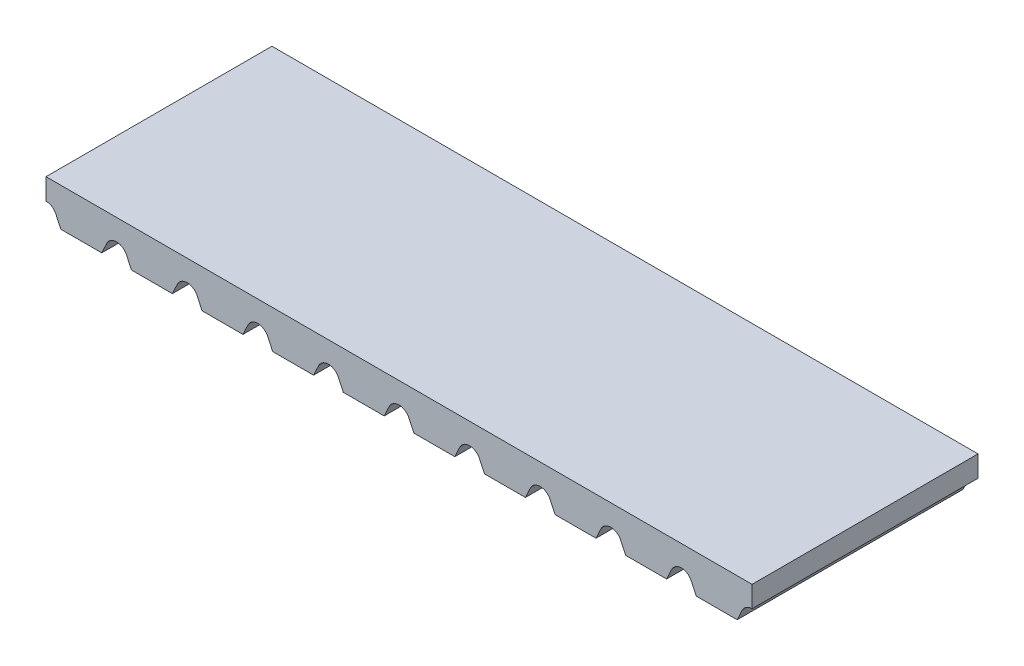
ISO-10303-21;
HEADER;
FILE_DESCRIPTION(('STEP AP214'),'2;1');
FILE_NAME('part.step','',(''),(''),'','','');
FILE_SCHEMA(('AUTOMOTIVE_DESIGN { 1 0 10303 214 1 1 1 1 }'));
ENDSEC;
DATA;
#1=APPLICATION_CONTEXT('core data for automotive mechanical design processes');
#2=APPLICATION_PROTOCOL_DEFINITION('international standard','automotive_design',2000,#1);
#3=PRODUCT_CONTEXT('',#1,'mechanical');
#4=PRODUCT('Part','Part','',(#3));
#5=PRODUCT_RELATED_PRODUCT_CATEGORY('part','',(#4));
#6=PRODUCT_DEFINITION_FORMATION('','',#4);
#7=PRODUCT_DEFINITION_CONTEXT('part definition',#1,'design');
#8=PRODUCT_DEFINITION('design','',#6,#7);
#9=PRODUCT_DEFINITION_SHAPE('','',#8);
#10=(LENGTH_UNIT() NAMED_UNIT(*) SI_UNIT(.MILLI.,.METRE.));
#11=(NAMED_UNIT(*) PLANE_ANGLE_UNIT() SI_UNIT($,.RADIAN.));
#12=(NAMED_UNIT(*) SI_UNIT($,.STERADIAN.) SOLID_ANGLE_UNIT());
#13=UNCERTAINTY_MEASURE_WITH_UNIT(LENGTH_MEASURE(1.E-05),#10,'distance_accuracy_value','');
#14=(GEOMETRIC_REPRESENTATION_CONTEXT(3) GLOBAL_UNCERTAINTY_ASSIGNED_CONTEXT((#13)) GLOBAL_UNIT_ASSIGNED_CONTEXT((#10,
#11,#12)) REPRESENTATION_CONTEXT('',''));
#15=CARTESIAN_POINT('',(0.,0.,0.));
#16=DIRECTION('',(0.,0.,1.));
#17=DIRECTION('',(1.,0.,0.));
#18=AXIS2_PLACEMENT_3D('',#15,#16,#17);
#19=CARTESIAN_POINT('',(-2.5,0.,-8.));
#20=DIRECTION('',(-1.,0.,0.));
#21=DIRECTION('',(0.,-1.,0.));
#22=AXIS2_PLACEMENT_3D('',#19,#20,#21);
#23=PLANE('',#22);
#24=DIRECTION('',(0.,0.,1.));
#25=VECTOR('',#24,1.);
#26=CARTESIAN_POINT('',(-2.5,-1.5,-8.));
#27=LINE('',#26,#25);
#28=CARTESIAN_POINT('',(-2.5,-1.5,-8.));
#29=VERTEX_POINT('',#28);
#30=CARTESIAN_POINT('',(-2.5,-1.5,8.));
#31=VERTEX_POINT('',#30);
#32=EDGE_CURVE('E33',#29,#31,#27,.T.);
#33=ORIENTED_EDGE('',*,*,#32,.T.);
#34=DIRECTION('',(0.,-1.,0.));
#35=VECTOR('',#34,1.);
#36=CARTESIAN_POINT('',(-2.5,0.,8.));
#37=LINE('',#36,#35);
#38=CARTESIAN_POINT('',(-2.5,0.,8.));
#39=VERTEX_POINT('',#38);
#40=EDGE_CURVE('E731',#39,#31,#37,.T.);
#41=ORIENTED_EDGE('',*,*,#40,.F.);
#42=DIRECTION('',(0.,0.,1.));
#43=VECTOR('',#42,1.);
#44=CARTESIAN_POINT('',(-2.5,0.,-8.));
#45=LINE('',#44,#43);
#46=CARTESIAN_POINT('',(-2.5,0.,-8.));
#47=VERTEX_POINT('',#46);
#48=EDGE_CURVE('E11',#47,#39,#45,.T.);
#49=ORIENTED_EDGE('',*,*,#48,.F.);
#50=DIRECTION('',(0.,-1.,0.));
#51=VECTOR('',#50,1.);
#52=CARTESIAN_POINT('',(-2.5,0.,-8.));
#53=LINE('',#52,#51);
#54=EDGE_CURVE('E758',#47,#29,#53,.T.);
#55=ORIENTED_EDGE('',*,*,#54,.T.);
#56=EDGE_LOOP('',(#33,#41,#49,#55));
#57=FACE_BOUND('',#56,.T.);
#58=ADVANCED_FACE('F30',(#57),#23,.T.);
#59=CARTESIAN_POINT('',(-2.5,0.,-8.));
#60=DIRECTION('',(0.,1.,0.));
#61=DIRECTION('',(0.,0.,1.));
#62=AXIS2_PLACEMENT_3D('',#59,#60,#61);
#63=PLANE('',#62);
#64=ORIENTED_EDGE('',*,*,#48,.T.);
#65=DIRECTION('',(-1.,0.,0.));
#66=VECTOR('',#65,1.);
#67=CARTESIAN_POINT('',(-2.5,0.,8.));
#68=LINE('',#67,#66);
#69=CARTESIAN_POINT('',(47.5,0.,8.));
#70=VERTEX_POINT('',#69);
#71=EDGE_CURVE('E755',#70,#39,#68,.T.);
#72=ORIENTED_EDGE('',*,*,#71,.F.);
#73=DIRECTION('',(0.,0.,1.));
#74=VECTOR('',#73,1.);
#75=CARTESIAN_POINT('',(47.5,0.,-8.));
#76=LINE('',#75,#74);
#77=CARTESIAN_POINT('',(47.5,0.,-8.));
#78=VERTEX_POINT('',#77);
#79=EDGE_CURVE('E419',#78,#70,#76,.T.);
#80=ORIENTED_EDGE('',*,*,#79,.F.);
#81=DIRECTION('',(-1.,0.,0.));
#82=VECTOR('',#81,1.);
#83=CARTESIAN_POINT('',(-2.5,0.,-8.));
#84=LINE('',#83,#82);
#85=EDGE_CURVE('E773',#78,#47,#84,.T.);
#86=ORIENTED_EDGE('',*,*,#85,.T.);
#87=EDGE_LOOP('',(#64,#72,#80,#86));
#88=FACE_BOUND('',#87,.T.);
#89=ADVANCED_FACE('F791',(#88),#63,.T.);
#90=CARTESIAN_POINT('',(2.5004030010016,-2.27280910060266,-8.));
#91=DIRECTION('',(0.,0.,1.));
#92=DIRECTION('',(1.,0.,0.));
#93=AXIS2_PLACEMENT_3D('',#90,#91,#92);
#94=CYLINDRICAL_SURFACE('',#93,0.772809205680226);
#95=DIRECTION('',(0.,0.,1.));
#96=VECTOR('',#95,1.);
#97=CARTESIAN_POINT('',(2.5,-1.5,-8.));
#98=LINE('',#97,#96);
#99=CARTESIAN_POINT('',(2.5,-1.5,-8.));
#100=VERTEX_POINT('',#99);
#101=CARTESIAN_POINT('',(2.5,-1.5,8.));
#102=VERTEX_POINT('',#101);
#103=EDGE_CURVE('E38',#100,#102,#98,.T.);
#104=ORIENTED_EDGE('',*,*,#103,.T.);
#105=CARTESIAN_POINT('',(2.5004030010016,-2.27280910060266,8.));
#106=DIRECTION('',(0.,0.,-1.));
#107=DIRECTION('',(1.,0.,0.));
#108=AXIS2_PLACEMENT_3D('',#105,#106,#107);
#109=CIRCLE('',#108,0.772809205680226);
#110=CARTESIAN_POINT('',(1.8,-1.94620581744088,8.));
#111=VERTEX_POINT('',#110);
#112=EDGE_CURVE('E752',#111,#102,#109,.T.);
#113=ORIENTED_EDGE('',*,*,#112,.F.);
#114=DIRECTION('',(0.,0.,1.));
#115=VECTOR('',#114,1.);
#116=CARTESIAN_POINT('',(1.8,-1.94620581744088,-8.));
#117=LINE('',#116,#115);
#118=CARTESIAN_POINT('',(1.8,-1.94620581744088,-8.));
#119=VERTEX_POINT('',#118);
#120=EDGE_CURVE('E777',#119,#111,#117,.T.);
#121=ORIENTED_EDGE('',*,*,#120,.F.);
#122=CARTESIAN_POINT('',(2.5004030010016,-2.27280910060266,-8.));
#123=DIRECTION('',(0.,0.,-1.));
#124=DIRECTION('',(1.,0.,0.));
#125=AXIS2_PLACEMENT_3D('',#122,#123,#124);
#126=CIRCLE('',#125,0.772809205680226);
#127=EDGE_CURVE('E52',#119,#100,#126,.T.);
#128=ORIENTED_EDGE('',*,*,#127,.T.);
#129=EDGE_LOOP('',(#104,#113,#121,#128));
#130=FACE_BOUND('',#129,.T.);
#131=ADVANCED_FACE('F993',(#130),#94,.F.);
#132=CARTESIAN_POINT('',(1.4485,-2.7,-8.));
#133=DIRECTION('',(0.906307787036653,-0.422618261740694,0.));
#134=DIRECTION('',(0.422618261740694,0.906307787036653,0.));
#135=AXIS2_PLACEMENT_3D('',#132,#133,#134);
#136=PLANE('',#135);
#137=ORIENTED_EDGE('',*,*,#120,.T.);
#138=DIRECTION('',(0.422618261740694,0.906307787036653,0.));
#139=VECTOR('',#138,1.);
#140=CARTESIAN_POINT('',(1.4485,-2.7,8.));
#141=LINE('',#140,#139);
#142=CARTESIAN_POINT('',(1.4485,-2.7,8.));
#143=VERTEX_POINT('',#142);
#144=EDGE_CURVE('E749',#143,#111,#141,.T.);
#145=ORIENTED_EDGE('',*,*,#144,.F.);
#146=DIRECTION('',(0.,0.,1.));
#147=VECTOR('',#146,1.);
#148=CARTESIAN_POINT('',(1.4485,-2.7,-8.));
#149=LINE('',#148,#147);
#150=CARTESIAN_POINT('',(1.4485,-2.7,-8.));
#151=VERTEX_POINT('',#150);
#152=EDGE_CURVE('E779',#151,#143,#149,.T.);
#153=ORIENTED_EDGE('',*,*,#152,.F.);
#154=DIRECTION('',(0.422618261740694,0.906307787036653,0.));
#155=VECTOR('',#154,1.);
#156=CARTESIAN_POINT('',(1.4485,-2.7,-8.));
#157=LINE('',#156,#155);
#158=EDGE_CURVE('E769',#151,#119,#157,.T.);
#159=ORIENTED_EDGE('',*,*,#158,.T.);
#160=EDGE_LOOP('',(#137,#145,#153,#159));
#161=FACE_BOUND('',#160,.T.);
#162=ADVANCED_FACE('F974',(#161),#136,.T.);
#163=CARTESIAN_POINT('',(-1.4485,-2.7,-8.));
#164=DIRECTION('',(0.,-1.,0.));
#165=DIRECTION('',(0.,0.,-1.));
#166=AXIS2_PLACEMENT_3D('',#163,#164,#165);
#167=PLANE('',#166);
#168=ORIENTED_EDGE('',*,*,#152,.T.);
#169=DIRECTION('',(1.,0.,0.));
#170=VECTOR('',#169,1.);
#171=CARTESIAN_POINT('',(-1.4485,-2.7,8.));
#172=LINE('',#171,#170);
#173=CARTESIAN_POINT('',(-1.4485,-2.7,8.));
#174=VERTEX_POINT('',#173);
#175=EDGE_CURVE('E746',#174,#143,#172,.T.);
#176=ORIENTED_EDGE('',*,*,#175,.F.);
#177=DIRECTION('',(0.,0.,1.));
#178=VECTOR('',#177,1.);
#179=CARTESIAN_POINT('',(-1.4485,-2.7,-8.));
#180=LINE('',#179,#178);
#181=CARTESIAN_POINT('',(-1.4485,-2.7,-8.));
#182=VERTEX_POINT('',#181);
#183=EDGE_CURVE('E781',#182,#174,#180,.T.);
#184=ORIENTED_EDGE('',*,*,#183,.F.);
#185=DIRECTION('',(1.,0.,0.));
#186=VECTOR('',#185,1.);
#187=CARTESIAN_POINT('',(-1.4485,-2.7,-8.));
#188=LINE('',#187,#186);
#189=EDGE_CURVE('E766',#182,#151,#188,.T.);
#190=ORIENTED_EDGE('',*,*,#189,.T.);
#191=EDGE_LOOP('',(#168,#176,#184,#190));
#192=FACE_BOUND('',#191,.T.);
#193=ADVANCED_FACE('F978',(#192),#167,.T.);
#194=CARTESIAN_POINT('',(-1.4485,-2.7,-8.));
#195=DIRECTION('',(-0.906307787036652,-0.422618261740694,0.));
#196=DIRECTION('',(0.422618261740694,-0.906307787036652,0.));
#197=AXIS2_PLACEMENT_3D('',#194,#195,#196);
#198=PLANE('',#197);
#199=ORIENTED_EDGE('',*,*,#183,.T.);
#200=DIRECTION('',(0.422618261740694,-0.906307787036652,0.));
#201=VECTOR('',#200,1.);
#202=CARTESIAN_POINT('',(-1.4485,-2.7,8.));
#203=LINE('',#202,#201);
#204=CARTESIAN_POINT('',(-1.8,-1.94620581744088,8.));
#205=VERTEX_POINT('',#204);
#206=EDGE_CURVE('E743',#205,#174,#203,.T.);
#207=ORIENTED_EDGE('',*,*,#206,.F.);
#208=DIRECTION('',(0.,0.,1.));
#209=VECTOR('',#208,1.);
#210=CARTESIAN_POINT('',(-1.8,-1.94620581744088,-8.));
#211=LINE('',#210,#209);
#212=CARTESIAN_POINT('',(-1.8,-1.94620581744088,-8.));
#213=VERTEX_POINT('',#212);
#214=EDGE_CURVE('E782',#213,#205,#211,.T.);
#215=ORIENTED_EDGE('',*,*,#214,.F.);
#216=DIRECTION('',(0.422618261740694,-0.906307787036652,0.));
#217=VECTOR('',#216,1.);
#218=CARTESIAN_POINT('',(-1.4485,-2.7,-8.));
#219=LINE('',#218,#217);
#220=EDGE_CURVE('E763',#213,#182,#219,.T.);
#221=ORIENTED_EDGE('',*,*,#220,.T.);
#222=EDGE_LOOP('',(#199,#207,#215,#221));
#223=FACE_BOUND('',#222,.T.);
#224=ADVANCED_FACE('F980',(#223),#198,.T.);
#225=CARTESIAN_POINT('',(-2.5004030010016,-2.27280910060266,-8.));
#226=DIRECTION('',(0.,0.,1.));
#227=DIRECTION('',(1.,0.,0.));
#228=AXIS2_PLACEMENT_3D('',#225,#226,#227);
#229=CYLINDRICAL_SURFACE('',#228,0.772809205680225);
#230=ORIENTED_EDGE('',*,*,#214,.T.);
#231=CARTESIAN_POINT('',(-2.5004030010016,-2.27280910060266,8.));
#232=DIRECTION('',(0.,0.,-1.));
#233=DIRECTION('',(1.,0.,0.));
#234=AXIS2_PLACEMENT_3D('',#231,#232,#233);
#235=CIRCLE('',#234,0.772809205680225);
#236=EDGE_CURVE('E740',#31,#205,#235,.T.);
#237=ORIENTED_EDGE('',*,*,#236,.F.);
#238=ORIENTED_EDGE('',*,*,#32,.F.);
#239=CARTESIAN_POINT('',(-2.5004030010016,-2.27280910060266,-8.));
#240=DIRECTION('',(0.,0.,-1.));
#241=DIRECTION('',(1.,0.,0.));
#242=AXIS2_PLACEMENT_3D('',#239,#240,#241);
#243=CIRCLE('',#242,0.772809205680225);
#244=EDGE_CURVE('E760',#29,#213,#243,.T.);
#245=ORIENTED_EDGE('',*,*,#244,.T.);
#246=EDGE_LOOP('',(#230,#237,#238,#245));
#247=FACE_BOUND('',#246,.T.);
#248=ADVANCED_FACE('F786',(#247),#229,.F.);
#249=CARTESIAN_POINT('',(-2.5004030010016,-2.27280910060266,-8.));
#250=DIRECTION('',(0.,0.,1.));
#251=DIRECTION('',(1.,0.,0.));
#252=AXIS2_PLACEMENT_3D('',#249,#250,#251);
#253=PLANE('',#252);
#254=ORIENTED_EDGE('',*,*,#54,.F.);
#255=ORIENTED_EDGE('',*,*,#85,.F.);
#256=DIRECTION('',(0.,1.,0.));
#257=VECTOR('',#256,1.);
#258=CARTESIAN_POINT('',(47.5,0.,-8.));
#259=LINE('',#258,#257);
#260=CARTESIAN_POINT('',(47.5,-1.5,-8.));
#261=VERTEX_POINT('',#260);
#262=EDGE_CURVE('E377',#261,#78,#259,.T.);
#263=ORIENTED_EDGE('',*,*,#262,.F.);
#264=CARTESIAN_POINT('',(47.5004030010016,-2.27280910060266,-8.));
#265=DIRECTION('',(0.,0.,-1.));
#266=DIRECTION('',(1.,0.,0.));
#267=AXIS2_PLACEMENT_3D('',#264,#265,#266);
#268=CIRCLE('',#267,0.772809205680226);
#269=CARTESIAN_POINT('',(46.8,-1.94620581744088,-8.));
#270=VERTEX_POINT('',#269);
#271=EDGE_CURVE('E414',#270,#261,#268,.T.);
#272=ORIENTED_EDGE('',*,*,#271,.F.);
#273=DIRECTION('',(0.422618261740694,0.906307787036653,0.));
#274=VECTOR('',#273,1.);
#275=CARTESIAN_POINT('',(46.4485,-2.7,-8.));
#276=LINE('',#275,#274);
#277=CARTESIAN_POINT('',(46.4485,-2.7,-8.));
#278=VERTEX_POINT('',#277);
#279=EDGE_CURVE('E411',#278,#270,#276,.T.);
#280=ORIENTED_EDGE('',*,*,#279,.F.);
#281=DIRECTION('',(1.,0.,0.));
#282=VECTOR('',#281,1.);
#283=CARTESIAN_POINT('',(43.5515,-2.7,-8.));
#284=LINE('',#283,#282);
#285=CARTESIAN_POINT('',(43.5515,-2.7,-8.));
#286=VERTEX_POINT('',#285);
#287=EDGE_CURVE('E408',#286,#278,#284,.T.);
#288=ORIENTED_EDGE('',*,*,#287,.F.);
#289=DIRECTION('',(0.422618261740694,-0.906307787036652,0.));
#290=VECTOR('',#289,1.);
#291=CARTESIAN_POINT('',(43.5515,-2.7,-8.));
#292=LINE('',#291,#290);
#293=CARTESIAN_POINT('',(43.2,-1.94620581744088,-8.));
#294=VERTEX_POINT('',#293);
#295=EDGE_CURVE('E406',#294,#286,#292,.T.);
#296=ORIENTED_EDGE('',*,*,#295,.F.);
#297=CARTESIAN_POINT('',(42.4995969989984,-2.27280910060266,-8.));
#298=DIRECTION('',(0.,0.,-1.));
#299=DIRECTION('',(1.,0.,0.));
#300=AXIS2_PLACEMENT_3D('',#297,#298,#299);
#301=CIRCLE('',#300,0.772809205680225);
#302=CARTESIAN_POINT('',(42.5,-1.5,-8.));
#303=VERTEX_POINT('',#302);
#304=EDGE_CURVE('E371',#303,#294,#301,.T.);
#305=ORIENTED_EDGE('',*,*,#304,.F.);
#306=CARTESIAN_POINT('',(42.5004030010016,-2.27280910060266,-8.));
#307=DIRECTION('',(0.,0.,-1.));
#308=DIRECTION('',(1.,0.,0.));
#309=AXIS2_PLACEMENT_3D('',#306,#307,#308);
#310=CIRCLE('',#309,0.772809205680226);
#311=CARTESIAN_POINT('',(41.8,-1.94620581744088,-8.));
#312=VERTEX_POINT('',#311);
#313=EDGE_CURVE('E453',#312,#303,#310,.T.);
#314=ORIENTED_EDGE('',*,*,#313,.F.);
#315=DIRECTION('',(0.422618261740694,0.906307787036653,0.));
#316=VECTOR('',#315,1.);
#317=CARTESIAN_POINT('',(41.4485,-2.7,-8.));
#318=LINE('',#317,#316);
#319=CARTESIAN_POINT('',(41.4485,-2.7,-8.));
#320=VERTEX_POINT('',#319);
#321=EDGE_CURVE('E450',#320,#312,#318,.T.);
#322=ORIENTED_EDGE('',*,*,#321,.F.);
#323=DIRECTION('',(1.,0.,0.));
#324=VECTOR('',#323,1.);
#325=CARTESIAN_POINT('',(38.5515,-2.7,-8.));
#326=LINE('',#325,#324);
#327=CARTESIAN_POINT('',(38.5515,-2.7,-8.));
#328=VERTEX_POINT('',#327);
#329=EDGE_CURVE('E447',#328,#320,#326,.T.);
#330=ORIENTED_EDGE('',*,*,#329,.F.);
#331=DIRECTION('',(0.422618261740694,-0.906307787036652,0.));
#332=VECTOR('',#331,1.);
#333=CARTESIAN_POINT('',(38.5515,-2.7,-8.));
#334=LINE('',#333,#332);
#335=CARTESIAN_POINT('',(38.2,-1.94620581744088,-8.));
#336=VERTEX_POINT('',#335);
#337=EDGE_CURVE('E444',#336,#328,#334,.T.);
#338=ORIENTED_EDGE('',*,*,#337,.F.);
#339=CARTESIAN_POINT('',(37.4995969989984,-2.27280910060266,-8.));
#340=DIRECTION('',(0.,0.,-1.));
#341=DIRECTION('',(1.,0.,0.));
#342=AXIS2_PLACEMENT_3D('',#339,#340,#341);
#343=CIRCLE('',#342,0.772809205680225);
#344=CARTESIAN_POINT('',(37.5,-1.5,-8.));
#345=VERTEX_POINT('',#344);
#346=EDGE_CURVE('E441',#345,#336,#343,.T.);
#347=ORIENTED_EDGE('',*,*,#346,.F.);
#348=CARTESIAN_POINT('',(37.5004030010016,-2.27280910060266,-8.));
#349=DIRECTION('',(0.,0.,-1.));
#350=DIRECTION('',(1.,0.,0.));
#351=AXIS2_PLACEMENT_3D('',#348,#349,#350);
#352=CIRCLE('',#351,0.772809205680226);
#353=CARTESIAN_POINT('',(36.8,-1.94620581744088,-8.));
#354=VERTEX_POINT('',#353);
#355=EDGE_CURVE('E492',#354,#345,#352,.T.);
#356=ORIENTED_EDGE('',*,*,#355,.F.);
#357=DIRECTION('',(0.422618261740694,0.906307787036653,0.));
#358=VECTOR('',#357,1.);
#359=CARTESIAN_POINT('',(36.4485,-2.7,-8.));
#360=LINE('',#359,#358);
#361=CARTESIAN_POINT('',(36.4485,-2.7,-8.));
#362=VERTEX_POINT('',#361);
#363=EDGE_CURVE('E489',#362,#354,#360,.T.);
#364=ORIENTED_EDGE('',*,*,#363,.F.);
#365=DIRECTION('',(1.,0.,0.));
#366=VECTOR('',#365,1.);
#367=CARTESIAN_POINT('',(33.5515,-2.7,-8.));
#368=LINE('',#367,#366);
#369=CARTESIAN_POINT('',(33.5515,-2.7,-8.));
#370=VERTEX_POINT('',#369);
#371=EDGE_CURVE('E486',#370,#362,#368,.T.);
#372=ORIENTED_EDGE('',*,*,#371,.F.);
#373=DIRECTION('',(0.422618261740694,-0.906307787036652,0.));
#374=VECTOR('',#373,1.);
#375=CARTESIAN_POINT('',(33.5515,-2.7,-8.));
#376=LINE('',#375,#374);
#377=CARTESIAN_POINT('',(33.2,-1.94620581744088,-8.));
#378=VERTEX_POINT('',#377);
#379=EDGE_CURVE('E483',#378,#370,#376,.T.);
#380=ORIENTED_EDGE('',*,*,#379,.F.);
#381=CARTESIAN_POINT('',(32.4995969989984,-2.27280910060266,-8.));
#382=DIRECTION('',(0.,0.,-1.));
#383=DIRECTION('',(1.,0.,0.));
#384=AXIS2_PLACEMENT_3D('',#381,#382,#383);
#385=CIRCLE('',#384,0.772809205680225);
#386=CARTESIAN_POINT('',(32.5,-1.5,-8.));
#387=VERTEX_POINT('',#386);
#388=EDGE_CURVE('E480',#387,#378,#385,.T.);
#389=ORIENTED_EDGE('',*,*,#388,.F.);
#390=CARTESIAN_POINT('',(32.5004030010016,-2.27280910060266,-8.));
#391=DIRECTION('',(0.,0.,-1.));
#392=DIRECTION('',(1.,0.,0.));
#393=AXIS2_PLACEMENT_3D('',#390,#391,#392);
#394=CIRCLE('',#393,0.772809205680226);
#395=CARTESIAN_POINT('',(31.8,-1.94620581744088,-8.));
#396=VERTEX_POINT('',#395);
#397=EDGE_CURVE('E531',#396,#387,#394,.T.);
#398=ORIENTED_EDGE('',*,*,#397,.F.);
#399=DIRECTION('',(0.422618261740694,0.906307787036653,0.));
#400=VECTOR('',#399,1.);
#401=CARTESIAN_POINT('',(31.4485,-2.7,-8.));
#402=LINE('',#401,#400);
#403=CARTESIAN_POINT('',(31.4485,-2.7,-8.));
#404=VERTEX_POINT('',#403);
#405=EDGE_CURVE('E528',#404,#396,#402,.T.);
#406=ORIENTED_EDGE('',*,*,#405,.F.);
#407=DIRECTION('',(1.,0.,0.));
#408=VECTOR('',#407,1.);
#409=CARTESIAN_POINT('',(28.5515,-2.7,-8.));
#410=LINE('',#409,#408);
#411=CARTESIAN_POINT('',(28.5515,-2.7,-8.));
#412=VERTEX_POINT('',#411);
#413=EDGE_CURVE('E525',#412,#404,#410,.T.);
#414=ORIENTED_EDGE('',*,*,#413,.F.);
#415=DIRECTION('',(0.422618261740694,-0.906307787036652,0.));
#416=VECTOR('',#415,1.);
#417=CARTESIAN_POINT('',(28.5515,-2.7,-8.));
#418=LINE('',#417,#416);
#419=CARTESIAN_POINT('',(28.2,-1.94620581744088,-8.));
#420=VERTEX_POINT('',#419);
#421=EDGE_CURVE('E522',#420,#412,#418,.T.);
#422=ORIENTED_EDGE('',*,*,#421,.F.);
#423=CARTESIAN_POINT('',(27.4995969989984,-2.27280910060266,-8.));
#424=DIRECTION('',(0.,0.,-1.));
#425=DIRECTION('',(1.,0.,0.));
#426=AXIS2_PLACEMENT_3D('',#423,#424,#425);
#427=CIRCLE('',#426,0.772809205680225);
#428=CARTESIAN_POINT('',(27.5,-1.5,-8.));
#429=VERTEX_POINT('',#428);
#430=EDGE_CURVE('E519',#429,#420,#427,.T.);
#431=ORIENTED_EDGE('',*,*,#430,.F.);
#432=CARTESIAN_POINT('',(27.5004030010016,-2.27280910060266,-8.));
#433=DIRECTION('',(0.,0.,-1.));
#434=DIRECTION('',(1.,0.,0.));
#435=AXIS2_PLACEMENT_3D('',#432,#433,#434);
#436=CIRCLE('',#435,0.772809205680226);
#437=CARTESIAN_POINT('',(26.8,-1.94620581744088,-8.));
#438=VERTEX_POINT('',#437);
#439=EDGE_CURVE('E570',#438,#429,#436,.T.);
#440=ORIENTED_EDGE('',*,*,#439,.F.);
#441=DIRECTION('',(0.422618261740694,0.906307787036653,0.));
#442=VECTOR('',#441,1.);
#443=CARTESIAN_POINT('',(26.4485,-2.7,-8.));
#444=LINE('',#443,#442);
#445=CARTESIAN_POINT('',(26.4485,-2.7,-8.));
#446=VERTEX_POINT('',#445);
#447=EDGE_CURVE('E567',#446,#438,#444,.T.);
#448=ORIENTED_EDGE('',*,*,#447,.F.);
#449=DIRECTION('',(1.,0.,0.));
#450=VECTOR('',#449,1.);
#451=CARTESIAN_POINT('',(23.5515,-2.7,-8.));
#452=LINE('',#451,#450);
#453=CARTESIAN_POINT('',(23.5515,-2.7,-8.));
#454=VERTEX_POINT('',#453);
#455=EDGE_CURVE('E564',#454,#446,#452,.T.);
#456=ORIENTED_EDGE('',*,*,#455,.F.);
#457=DIRECTION('',(0.422618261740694,-0.906307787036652,0.));
#458=VECTOR('',#457,1.);
#459=CARTESIAN_POINT('',(23.5515,-2.7,-8.));
#460=LINE('',#459,#458);
#461=CARTESIAN_POINT('',(23.2,-1.94620581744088,-8.));
#462=VERTEX_POINT('',#461);
#463=EDGE_CURVE('E561',#462,#454,#460,.T.);
#464=ORIENTED_EDGE('',*,*,#463,.F.);
#465=CARTESIAN_POINT('',(22.4995969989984,-2.27280910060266,-8.));
#466=DIRECTION('',(0.,0.,-1.));
#467=DIRECTION('',(1.,0.,0.));
#468=AXIS2_PLACEMENT_3D('',#465,#466,#467);
#469=CIRCLE('',#468,0.772809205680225);
#470=CARTESIAN_POINT('',(22.5,-1.5,-8.));
#471=VERTEX_POINT('',#470);
#472=EDGE_CURVE('E558',#471,#462,#469,.T.);
#473=ORIENTED_EDGE('',*,*,#472,.F.);
#474=CARTESIAN_POINT('',(22.5004030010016,-2.27280910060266,-8.));
#475=DIRECTION('',(0.,0.,-1.));
#476=DIRECTION('',(1.,0.,0.));
#477=AXIS2_PLACEMENT_3D('',#474,#475,#476);
#478=CIRCLE('',#477,0.772809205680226);
#479=CARTESIAN_POINT('',(21.8,-1.94620581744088,-8.));
#480=VERTEX_POINT('',#479);
#481=EDGE_CURVE('E609',#480,#471,#478,.T.);
#482=ORIENTED_EDGE('',*,*,#481,.F.);
#483=DIRECTION('',(0.422618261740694,0.906307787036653,0.));
#484=VECTOR('',#483,1.);
#485=CARTESIAN_POINT('',(21.4485,-2.7,-8.));
#486=LINE('',#485,#484);
#487=CARTESIAN_POINT('',(21.4485,-2.7,-8.));
#488=VERTEX_POINT('',#487);
#489=EDGE_CURVE('E606',#488,#480,#486,.T.);
#490=ORIENTED_EDGE('',*,*,#489,.F.);
#491=DIRECTION('',(1.,0.,0.));
#492=VECTOR('',#491,1.);
#493=CARTESIAN_POINT('',(18.5515,-2.7,-8.));
#494=LINE('',#493,#492);
#495=CARTESIAN_POINT('',(18.5515,-2.7,-8.));
#496=VERTEX_POINT('',#495);
#497=EDGE_CURVE('E603',#496,#488,#494,.T.);
#498=ORIENTED_EDGE('',*,*,#497,.F.);
#499=DIRECTION('',(0.422618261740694,-0.906307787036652,0.));
#500=VECTOR('',#499,1.);
#501=CARTESIAN_POINT('',(18.5515,-2.7,-8.));
#502=LINE('',#501,#500);
#503=CARTESIAN_POINT('',(18.2,-1.94620581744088,-8.));
#504=VERTEX_POINT('',#503);
#505=EDGE_CURVE('E600',#504,#496,#502,.T.);
#506=ORIENTED_EDGE('',*,*,#505,.F.);
#507=CARTESIAN_POINT('',(17.4995969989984,-2.27280910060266,-8.));
#508=DIRECTION('',(0.,0.,-1.));
#509=DIRECTION('',(1.,0.,0.));
#510=AXIS2_PLACEMENT_3D('',#507,#508,#509);
#511=CIRCLE('',#510,0.772809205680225);
#512=CARTESIAN_POINT('',(17.5,-1.5,-8.));
#513=VERTEX_POINT('',#512);
#514=EDGE_CURVE('E597',#513,#504,#511,.T.);
#515=ORIENTED_EDGE('',*,*,#514,.F.);
#516=CARTESIAN_POINT('',(17.5004030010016,-2.27280910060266,-8.));
#517=DIRECTION('',(0.,0.,-1.));
#518=DIRECTION('',(1.,0.,0.));
#519=AXIS2_PLACEMENT_3D('',#516,#517,#518);
#520=CIRCLE('',#519,0.772809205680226);
#521=CARTESIAN_POINT('',(16.8,-1.94620581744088,-8.));
#522=VERTEX_POINT('',#521);
#523=EDGE_CURVE('E648',#522,#513,#520,.T.);
#524=ORIENTED_EDGE('',*,*,#523,.F.);
#525=DIRECTION('',(0.422618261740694,0.906307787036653,0.));
#526=VECTOR('',#525,1.);
#527=CARTESIAN_POINT('',(16.4485,-2.7,-8.));
#528=LINE('',#527,#526);
#529=CARTESIAN_POINT('',(16.4485,-2.7,-8.));
#530=VERTEX_POINT('',#529);
#531=EDGE_CURVE('E645',#530,#522,#528,.T.);
#532=ORIENTED_EDGE('',*,*,#531,.F.);
#533=DIRECTION('',(1.,0.,0.));
#534=VECTOR('',#533,1.);
#535=CARTESIAN_POINT('',(13.5515,-2.7,-8.));
#536=LINE('',#535,#534);
#537=CARTESIAN_POINT('',(13.5515,-2.7,-8.));
#538=VERTEX_POINT('',#537);
#539=EDGE_CURVE('E642',#538,#530,#536,.T.);
#540=ORIENTED_EDGE('',*,*,#539,.F.);
#541=DIRECTION('',(0.422618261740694,-0.906307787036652,0.));
#542=VECTOR('',#541,1.);
#543=CARTESIAN_POINT('',(13.5515,-2.7,-8.));
#544=LINE('',#543,#542);
#545=CARTESIAN_POINT('',(13.2,-1.94620581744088,-8.));
#546=VERTEX_POINT('',#545);
#547=EDGE_CURVE('E639',#546,#538,#544,.T.);
#548=ORIENTED_EDGE('',*,*,#547,.F.);
#549=CARTESIAN_POINT('',(12.4995969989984,-2.27280910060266,-8.));
#550=DIRECTION('',(0.,0.,-1.));
#551=DIRECTION('',(1.,0.,0.));
#552=AXIS2_PLACEMENT_3D('',#549,#550,#551);
#553=CIRCLE('',#552,0.772809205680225);
#554=CARTESIAN_POINT('',(12.5,-1.5,-8.));
#555=VERTEX_POINT('',#554);
#556=EDGE_CURVE('E636',#555,#546,#553,.T.);
#557=ORIENTED_EDGE('',*,*,#556,.F.);
#558=CARTESIAN_POINT('',(12.5004030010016,-2.27280910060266,-8.));
#559=DIRECTION('',(0.,0.,-1.));
#560=DIRECTION('',(1.,0.,0.));
#561=AXIS2_PLACEMENT_3D('',#558,#559,#560);
#562=CIRCLE('',#561,0.772809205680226);
#563=CARTESIAN_POINT('',(11.8,-1.94620581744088,-8.));
#564=VERTEX_POINT('',#563);
#565=EDGE_CURVE('E687',#564,#555,#562,.T.);
#566=ORIENTED_EDGE('',*,*,#565,.F.);
#567=DIRECTION('',(0.422618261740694,0.906307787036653,0.));
#568=VECTOR('',#567,1.);
#569=CARTESIAN_POINT('',(11.4485,-2.7,-8.));
#570=LINE('',#569,#568);
#571=CARTESIAN_POINT('',(11.4485,-2.7,-8.));
#572=VERTEX_POINT('',#571);
#573=EDGE_CURVE('E684',#572,#564,#570,.T.);
#574=ORIENTED_EDGE('',*,*,#573,.F.);
#575=DIRECTION('',(1.,0.,0.));
#576=VECTOR('',#575,1.);
#577=CARTESIAN_POINT('',(8.5515,-2.7,-8.));
#578=LINE('',#577,#576);
#579=CARTESIAN_POINT('',(8.5515,-2.7,-8.));
#580=VERTEX_POINT('',#579);
#581=EDGE_CURVE('E681',#580,#572,#578,.T.);
#582=ORIENTED_EDGE('',*,*,#581,.F.);
#583=DIRECTION('',(0.422618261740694,-0.906307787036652,0.));
#584=VECTOR('',#583,1.);
#585=CARTESIAN_POINT('',(8.5515,-2.7,-8.));
#586=LINE('',#585,#584);
#587=CARTESIAN_POINT('',(8.2,-1.94620581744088,-8.));
#588=VERTEX_POINT('',#587);
#589=EDGE_CURVE('E678',#588,#580,#586,.T.);
#590=ORIENTED_EDGE('',*,*,#589,.F.);
#591=CARTESIAN_POINT('',(7.4995969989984,-2.27280910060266,-8.));
#592=DIRECTION('',(0.,0.,-1.));
#593=DIRECTION('',(1.,0.,0.));
#594=AXIS2_PLACEMENT_3D('',#591,#592,#593);
#595=CIRCLE('',#594,0.772809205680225);
#596=CARTESIAN_POINT('',(7.5,-1.5,-8.));
#597=VERTEX_POINT('',#596);
#598=EDGE_CURVE('E675',#597,#588,#595,.T.);
#599=ORIENTED_EDGE('',*,*,#598,.F.);
#600=CARTESIAN_POINT('',(7.5004030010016,-2.27280910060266,-8.));
#601=DIRECTION('',(0.,0.,-1.));
#602=DIRECTION('',(1.,0.,0.));
#603=AXIS2_PLACEMENT_3D('',#600,#601,#602);
#604=CIRCLE('',#603,0.772809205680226);
#605=CARTESIAN_POINT('',(6.8,-1.94620581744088,-8.));
#606=VERTEX_POINT('',#605);
#607=EDGE_CURVE('E726',#606,#597,#604,.T.);
#608=ORIENTED_EDGE('',*,*,#607,.F.);
#609=DIRECTION('',(0.422618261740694,0.906307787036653,0.));
#610=VECTOR('',#609,1.);
#611=CARTESIAN_POINT('',(6.4485,-2.7,-8.));
#612=LINE('',#611,#610);
#613=CARTESIAN_POINT('',(6.4485,-2.7,-8.));
#614=VERTEX_POINT('',#613);
#615=EDGE_CURVE('E723',#614,#606,#612,.T.);
#616=ORIENTED_EDGE('',*,*,#615,.F.);
#617=DIRECTION('',(1.,0.,0.));
#618=VECTOR('',#617,1.);
#619=CARTESIAN_POINT('',(3.5515,-2.7,-8.));
#620=LINE('',#619,#618);
#621=CARTESIAN_POINT('',(3.5515,-2.7,-8.));
#622=VERTEX_POINT('',#621);
#623=EDGE_CURVE('E720',#622,#614,#620,.T.);
#624=ORIENTED_EDGE('',*,*,#623,.F.);
#625=DIRECTION('',(0.422618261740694,-0.906307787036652,0.));
#626=VECTOR('',#625,1.);
#627=CARTESIAN_POINT('',(3.5515,-2.7,-8.));
#628=LINE('',#627,#626);
#629=CARTESIAN_POINT('',(3.2,-1.94620581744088,-8.));
#630=VERTEX_POINT('',#629);
#631=EDGE_CURVE('E717',#630,#622,#628,.T.);
#632=ORIENTED_EDGE('',*,*,#631,.F.);
#633=CARTESIAN_POINT('',(2.4995969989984,-2.27280910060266,-8.));
#634=DIRECTION('',(0.,0.,-1.));
#635=DIRECTION('',(1.,0.,0.));
#636=AXIS2_PLACEMENT_3D('',#633,#634,#635);
#637=CIRCLE('',#636,0.772809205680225);
#638=EDGE_CURVE('E714',#100,#630,#637,.T.);
#639=ORIENTED_EDGE('',*,*,#638,.F.);
#640=ORIENTED_EDGE('',*,*,#127,.F.);
#641=ORIENTED_EDGE('',*,*,#158,.F.);
#642=ORIENTED_EDGE('',*,*,#189,.F.);
#643=ORIENTED_EDGE('',*,*,#220,.F.);
#644=ORIENTED_EDGE('',*,*,#244,.F.);
#645=EDGE_LOOP('',(#254,#255,#263,#272,#280,#288,#296,#305,#314,#322,#330,#338,#347,#356,#364,
#372,#380,#389,#398,#406,#414,#422,#431,#440,#448,#456,#464,#473,#482,#490,#498,#506,#515,#524,
#532,#540,#548,#557,#566,#574,#582,#590,#599,#608,#616,#624,#632,#639,#640,#641,#642,#643,#644));
#646=FACE_BOUND('',#645,.T.);
#647=ADVANCED_FACE('F797',(#646),#253,.F.);
#648=CARTESIAN_POINT('',(-2.5004030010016,-2.27280910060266,8.));
#649=DIRECTION('',(0.,0.,1.));
#650=DIRECTION('',(1.,0.,0.));
#651=AXIS2_PLACEMENT_3D('',#648,#649,#650);
#652=PLANE('',#651);
#653=ORIENTED_EDGE('',*,*,#40,.T.);
#654=ORIENTED_EDGE('',*,*,#236,.T.);
#655=ORIENTED_EDGE('',*,*,#206,.T.);
#656=ORIENTED_EDGE('',*,*,#175,.T.);
#657=ORIENTED_EDGE('',*,*,#144,.T.);
#658=ORIENTED_EDGE('',*,*,#112,.T.);
#659=CARTESIAN_POINT('',(2.4995969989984,-2.27280910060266,8.));
#660=DIRECTION('',(0.,0.,-1.));
#661=DIRECTION('',(1.,0.,0.));
#662=AXIS2_PLACEMENT_3D('',#659,#660,#661);
#663=CIRCLE('',#662,0.772809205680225);
#664=CARTESIAN_POINT('',(3.2,-1.94620581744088,8.));
#665=VERTEX_POINT('',#664);
#666=EDGE_CURVE('E692',#102,#665,#663,.T.);
#667=ORIENTED_EDGE('',*,*,#666,.T.);
#668=DIRECTION('',(0.422618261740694,-0.906307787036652,0.));
#669=VECTOR('',#668,1.);
#670=CARTESIAN_POINT('',(3.5515,-2.7,8.));
#671=LINE('',#670,#669);
#672=CARTESIAN_POINT('',(3.5515,-2.7,8.));
#673=VERTEX_POINT('',#672);
#674=EDGE_CURVE('E702',#665,#673,#671,.T.);
#675=ORIENTED_EDGE('',*,*,#674,.T.);
#676=DIRECTION('',(1.,0.,0.));
#677=VECTOR('',#676,1.);
#678=CARTESIAN_POINT('',(3.5515,-2.7,8.));
#679=LINE('',#678,#677);
#680=CARTESIAN_POINT('',(6.4485,-2.7,8.));
#681=VERTEX_POINT('',#680);
#682=EDGE_CURVE('E705',#673,#681,#679,.T.);
#683=ORIENTED_EDGE('',*,*,#682,.T.);
#684=DIRECTION('',(0.422618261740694,0.906307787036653,0.));
#685=VECTOR('',#684,1.);
#686=CARTESIAN_POINT('',(6.4485,-2.7,8.));
#687=LINE('',#686,#685);
#688=CARTESIAN_POINT('',(6.8,-1.94620581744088,8.));
#689=VERTEX_POINT('',#688);
#690=EDGE_CURVE('E708',#681,#689,#687,.T.);
#691=ORIENTED_EDGE('',*,*,#690,.T.);
#692=CARTESIAN_POINT('',(7.5004030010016,-2.27280910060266,8.));
#693=DIRECTION('',(0.,0.,-1.));
#694=DIRECTION('',(1.,0.,0.));
#695=AXIS2_PLACEMENT_3D('',#692,#693,#694);
#696=CIRCLE('',#695,0.772809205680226);
#697=CARTESIAN_POINT('',(7.5,-1.5,8.));
#698=VERTEX_POINT('',#697);
#699=EDGE_CURVE('E711',#689,#698,#696,.T.);
#700=ORIENTED_EDGE('',*,*,#699,.T.);
#701=CARTESIAN_POINT('',(7.4995969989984,-2.27280910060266,8.));
#702=DIRECTION('',(0.,0.,-1.));
#703=DIRECTION('',(1.,0.,0.));
#704=AXIS2_PLACEMENT_3D('',#701,#702,#703);
#705=CIRCLE('',#704,0.772809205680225);
#706=CARTESIAN_POINT('',(8.2,-1.94620581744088,8.));
#707=VERTEX_POINT('',#706);
#708=EDGE_CURVE('E653',#698,#707,#705,.T.);
#709=ORIENTED_EDGE('',*,*,#708,.T.);
#710=DIRECTION('',(0.422618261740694,-0.906307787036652,0.));
#711=VECTOR('',#710,1.);
#712=CARTESIAN_POINT('',(8.5515,-2.7,8.));
#713=LINE('',#712,#711);
#714=CARTESIAN_POINT('',(8.5515,-2.7,8.));
#715=VERTEX_POINT('',#714);
#716=EDGE_CURVE('E663',#707,#715,#713,.T.);
#717=ORIENTED_EDGE('',*,*,#716,.T.);
#718=DIRECTION('',(1.,0.,0.));
#719=VECTOR('',#718,1.);
#720=CARTESIAN_POINT('',(8.5515,-2.7,8.));
#721=LINE('',#720,#719);
#722=CARTESIAN_POINT('',(11.4485,-2.7,8.));
#723=VERTEX_POINT('',#722);
#724=EDGE_CURVE('E666',#715,#723,#721,.T.);
#725=ORIENTED_EDGE('',*,*,#724,.T.);
#726=DIRECTION('',(0.422618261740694,0.906307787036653,0.));
#727=VECTOR('',#726,1.);
#728=CARTESIAN_POINT('',(11.4485,-2.7,8.));
#729=LINE('',#728,#727);
#730=CARTESIAN_POINT('',(11.8,-1.94620581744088,8.));
#731=VERTEX_POINT('',#730);
#732=EDGE_CURVE('E669',#723,#731,#729,.T.);
#733=ORIENTED_EDGE('',*,*,#732,.T.);
#734=CARTESIAN_POINT('',(12.5004030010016,-2.27280910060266,8.));
#735=DIRECTION('',(0.,0.,-1.));
#736=DIRECTION('',(1.,0.,0.));
#737=AXIS2_PLACEMENT_3D('',#734,#735,#736);
#738=CIRCLE('',#737,0.772809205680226);
#739=CARTESIAN_POINT('',(12.5,-1.5,8.));
#740=VERTEX_POINT('',#739);
#741=EDGE_CURVE('E672',#731,#740,#738,.T.);
#742=ORIENTED_EDGE('',*,*,#741,.T.);
#743=CARTESIAN_POINT('',(12.4995969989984,-2.27280910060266,8.));
#744=DIRECTION('',(0.,0.,-1.));
#745=DIRECTION('',(1.,0.,0.));
#746=AXIS2_PLACEMENT_3D('',#743,#744,#745);
#747=CIRCLE('',#746,0.772809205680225);
#748=CARTESIAN_POINT('',(13.2,-1.94620581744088,8.));
#749=VERTEX_POINT('',#748);
#750=EDGE_CURVE('E614',#740,#749,#747,.T.);
#751=ORIENTED_EDGE('',*,*,#750,.T.);
#752=DIRECTION('',(0.422618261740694,-0.906307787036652,0.));
#753=VECTOR('',#752,1.);
#754=CARTESIAN_POINT('',(13.5515,-2.7,8.));
#755=LINE('',#754,#753);
#756=CARTESIAN_POINT('',(13.5515,-2.7,8.));
#757=VERTEX_POINT('',#756);
#758=EDGE_CURVE('E624',#749,#757,#755,.T.);
#759=ORIENTED_EDGE('',*,*,#758,.T.);
#760=DIRECTION('',(1.,0.,0.));
#761=VECTOR('',#760,1.);
#762=CARTESIAN_POINT('',(13.5515,-2.7,8.));
#763=LINE('',#762,#761);
#764=CARTESIAN_POINT('',(16.4485,-2.7,8.));
#765=VERTEX_POINT('',#764);
#766=EDGE_CURVE('E627',#757,#765,#763,.T.);
#767=ORIENTED_EDGE('',*,*,#766,.T.);
#768=DIRECTION('',(0.422618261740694,0.906307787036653,0.));
#769=VECTOR('',#768,1.);
#770=CARTESIAN_POINT('',(16.4485,-2.7,8.));
#771=LINE('',#770,#769);
#772=CARTESIAN_POINT('',(16.8,-1.94620581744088,8.));
#773=VERTEX_POINT('',#772);
#774=EDGE_CURVE('E630',#765,#773,#771,.T.);
#775=ORIENTED_EDGE('',*,*,#774,.T.);
#776=CARTESIAN_POINT('',(17.5004030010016,-2.27280910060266,8.));
#777=DIRECTION('',(0.,0.,-1.));
#778=DIRECTION('',(1.,0.,0.));
#779=AXIS2_PLACEMENT_3D('',#776,#777,#778);
#780=CIRCLE('',#779,0.772809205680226);
#781=CARTESIAN_POINT('',(17.5,-1.5,8.));
#782=VERTEX_POINT('',#781);
#783=EDGE_CURVE('E633',#773,#782,#780,.T.);
#784=ORIENTED_EDGE('',*,*,#783,.T.);
#785=CARTESIAN_POINT('',(17.4995969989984,-2.27280910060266,8.));
#786=DIRECTION('',(0.,0.,-1.));
#787=DIRECTION('',(1.,0.,0.));
#788=AXIS2_PLACEMENT_3D('',#785,#786,#787);
#789=CIRCLE('',#788,0.772809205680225);
#790=CARTESIAN_POINT('',(18.2,-1.94620581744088,8.));
#791=VERTEX_POINT('',#790);
#792=EDGE_CURVE('E575',#782,#791,#789,.T.);
#793=ORIENTED_EDGE('',*,*,#792,.T.);
#794=DIRECTION('',(0.422618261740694,-0.906307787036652,0.));
#795=VECTOR('',#794,1.);
#796=CARTESIAN_POINT('',(18.5515,-2.7,8.));
#797=LINE('',#796,#795);
#798=CARTESIAN_POINT('',(18.5515,-2.7,8.));
#799=VERTEX_POINT('',#798);
#800=EDGE_CURVE('E585',#791,#799,#797,.T.);
#801=ORIENTED_EDGE('',*,*,#800,.T.);
#802=DIRECTION('',(1.,0.,0.));
#803=VECTOR('',#802,1.);
#804=CARTESIAN_POINT('',(18.5515,-2.7,8.));
#805=LINE('',#804,#803);
#806=CARTESIAN_POINT('',(21.4485,-2.7,8.));
#807=VERTEX_POINT('',#806);
#808=EDGE_CURVE('E588',#799,#807,#805,.T.);
#809=ORIENTED_EDGE('',*,*,#808,.T.);
#810=DIRECTION('',(0.422618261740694,0.906307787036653,0.));
#811=VECTOR('',#810,1.);
#812=CARTESIAN_POINT('',(21.4485,-2.7,8.));
#813=LINE('',#812,#811);
#814=CARTESIAN_POINT('',(21.8,-1.94620581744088,8.));
#815=VERTEX_POINT('',#814);
#816=EDGE_CURVE('E591',#807,#815,#813,.T.);
#817=ORIENTED_EDGE('',*,*,#816,.T.);
#818=CARTESIAN_POINT('',(22.5004030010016,-2.27280910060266,8.));
#819=DIRECTION('',(0.,0.,-1.));
#820=DIRECTION('',(1.,0.,0.));
#821=AXIS2_PLACEMENT_3D('',#818,#819,#820);
#822=CIRCLE('',#821,0.772809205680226);
#823=CARTESIAN_POINT('',(22.5,-1.5,8.));
#824=VERTEX_POINT('',#823);
#825=EDGE_CURVE('E594',#815,#824,#822,.T.);
#826=ORIENTED_EDGE('',*,*,#825,.T.);
#827=CARTESIAN_POINT('',(22.4995969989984,-2.27280910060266,8.));
#828=DIRECTION('',(0.,0.,-1.));
#829=DIRECTION('',(1.,0.,0.));
#830=AXIS2_PLACEMENT_3D('',#827,#828,#829);
#831=CIRCLE('',#830,0.772809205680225);
#832=CARTESIAN_POINT('',(23.2,-1.94620581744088,8.));
#833=VERTEX_POINT('',#832);
#834=EDGE_CURVE('E536',#824,#833,#831,.T.);
#835=ORIENTED_EDGE('',*,*,#834,.T.);
#836=DIRECTION('',(0.422618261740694,-0.906307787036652,0.));
#837=VECTOR('',#836,1.);
#838=CARTESIAN_POINT('',(23.5515,-2.7,8.));
#839=LINE('',#838,#837);
#840=CARTESIAN_POINT('',(23.5515,-2.7,8.));
#841=VERTEX_POINT('',#840);
#842=EDGE_CURVE('E546',#833,#841,#839,.T.);
#843=ORIENTED_EDGE('',*,*,#842,.T.);
#844=DIRECTION('',(1.,0.,0.));
#845=VECTOR('',#844,1.);
#846=CARTESIAN_POINT('',(23.5515,-2.7,8.));
#847=LINE('',#846,#845);
#848=CARTESIAN_POINT('',(26.4485,-2.7,8.));
#849=VERTEX_POINT('',#848);
#850=EDGE_CURVE('E549',#841,#849,#847,.T.);
#851=ORIENTED_EDGE('',*,*,#850,.T.);
#852=DIRECTION('',(0.422618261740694,0.906307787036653,0.));
#853=VECTOR('',#852,1.);
#854=CARTESIAN_POINT('',(26.4485,-2.7,8.));
#855=LINE('',#854,#853);
#856=CARTESIAN_POINT('',(26.8,-1.94620581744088,8.));
#857=VERTEX_POINT('',#856);
#858=EDGE_CURVE('E552',#849,#857,#855,.T.);
#859=ORIENTED_EDGE('',*,*,#858,.T.);
#860=CARTESIAN_POINT('',(27.5004030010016,-2.27280910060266,8.));
#861=DIRECTION('',(0.,0.,-1.));
#862=DIRECTION('',(1.,0.,0.));
#863=AXIS2_PLACEMENT_3D('',#860,#861,#862);
#864=CIRCLE('',#863,0.772809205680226);
#865=CARTESIAN_POINT('',(27.5,-1.5,8.));
#866=VERTEX_POINT('',#865);
#867=EDGE_CURVE('E555',#857,#866,#864,.T.);
#868=ORIENTED_EDGE('',*,*,#867,.T.);
#869=CARTESIAN_POINT('',(27.4995969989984,-2.27280910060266,8.));
#870=DIRECTION('',(0.,0.,-1.));
#871=DIRECTION('',(1.,0.,0.));
#872=AXIS2_PLACEMENT_3D('',#869,#870,#871);
#873=CIRCLE('',#872,0.772809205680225);
#874=CARTESIAN_POINT('',(28.2,-1.94620581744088,8.));
#875=VERTEX_POINT('',#874);
#876=EDGE_CURVE('E497',#866,#875,#873,.T.);
#877=ORIENTED_EDGE('',*,*,#876,.T.);
#878=DIRECTION('',(0.422618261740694,-0.906307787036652,0.));
#879=VECTOR('',#878,1.);
#880=CARTESIAN_POINT('',(28.5515,-2.7,8.));
#881=LINE('',#880,#879);
#882=CARTESIAN_POINT('',(28.5515,-2.7,8.));
#883=VERTEX_POINT('',#882);
#884=EDGE_CURVE('E507',#875,#883,#881,.T.);
#885=ORIENTED_EDGE('',*,*,#884,.T.);
#886=DIRECTION('',(1.,0.,0.));
#887=VECTOR('',#886,1.);
#888=CARTESIAN_POINT('',(28.5515,-2.7,8.));
#889=LINE('',#888,#887);
#890=CARTESIAN_POINT('',(31.4485,-2.7,8.));
#891=VERTEX_POINT('',#890);
#892=EDGE_CURVE('E510',#883,#891,#889,.T.);
#893=ORIENTED_EDGE('',*,*,#892,.T.);
#894=DIRECTION('',(0.422618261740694,0.906307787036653,0.));
#895=VECTOR('',#894,1.);
#896=CARTESIAN_POINT('',(31.4485,-2.7,8.));
#897=LINE('',#896,#895);
#898=CARTESIAN_POINT('',(31.8,-1.94620581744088,8.));
#899=VERTEX_POINT('',#898);
#900=EDGE_CURVE('E513',#891,#899,#897,.T.);
#901=ORIENTED_EDGE('',*,*,#900,.T.);
#902=CARTESIAN_POINT('',(32.5004030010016,-2.27280910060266,8.));
#903=DIRECTION('',(0.,0.,-1.));
#904=DIRECTION('',(1.,0.,0.));
#905=AXIS2_PLACEMENT_3D('',#902,#903,#904);
#906=CIRCLE('',#905,0.772809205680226);
#907=CARTESIAN_POINT('',(32.5,-1.5,8.));
#908=VERTEX_POINT('',#907);
#909=EDGE_CURVE('E516',#899,#908,#906,.T.);
#910=ORIENTED_EDGE('',*,*,#909,.T.);
#911=CARTESIAN_POINT('',(32.4995969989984,-2.27280910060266,8.));
#912=DIRECTION('',(0.,0.,-1.));
#913=DIRECTION('',(1.,0.,0.));
#914=AXIS2_PLACEMENT_3D('',#911,#912,#913);
#915=CIRCLE('',#914,0.772809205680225);
#916=CARTESIAN_POINT('',(33.2,-1.94620581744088,8.));
#917=VERTEX_POINT('',#916);
#918=EDGE_CURVE('E458',#908,#917,#915,.T.);
#919=ORIENTED_EDGE('',*,*,#918,.T.);
#920=DIRECTION('',(0.422618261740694,-0.906307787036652,0.));
#921=VECTOR('',#920,1.);
#922=CARTESIAN_POINT('',(33.5515,-2.7,8.));
#923=LINE('',#922,#921);
#924=CARTESIAN_POINT('',(33.5515,-2.7,8.));
#925=VERTEX_POINT('',#924);
#926=EDGE_CURVE('E468',#917,#925,#923,.T.);
#927=ORIENTED_EDGE('',*,*,#926,.T.);
#928=DIRECTION('',(1.,0.,0.));
#929=VECTOR('',#928,1.);
#930=CARTESIAN_POINT('',(33.5515,-2.7,8.));
#931=LINE('',#930,#929);
#932=CARTESIAN_POINT('',(36.4485,-2.7,8.));
#933=VERTEX_POINT('',#932);
#934=EDGE_CURVE('E471',#925,#933,#931,.T.);
#935=ORIENTED_EDGE('',*,*,#934,.T.);
#936=DIRECTION('',(0.422618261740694,0.906307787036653,0.));
#937=VECTOR('',#936,1.);
#938=CARTESIAN_POINT('',(36.4485,-2.7,8.));
#939=LINE('',#938,#937);
#940=CARTESIAN_POINT('',(36.8,-1.94620581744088,8.));
#941=VERTEX_POINT('',#940);
#942=EDGE_CURVE('E474',#933,#941,#939,.T.);
#943=ORIENTED_EDGE('',*,*,#942,.T.);
#944=CARTESIAN_POINT('',(37.5004030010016,-2.27280910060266,8.));
#945=DIRECTION('',(0.,0.,-1.));
#946=DIRECTION('',(1.,0.,0.));
#947=AXIS2_PLACEMENT_3D('',#944,#945,#946);
#948=CIRCLE('',#947,0.772809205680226);
#949=CARTESIAN_POINT('',(37.5,-1.5,8.));
#950=VERTEX_POINT('',#949);
#951=EDGE_CURVE('E477',#941,#950,#948,.T.);
#952=ORIENTED_EDGE('',*,*,#951,.T.);
#953=CARTESIAN_POINT('',(37.4995969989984,-2.27280910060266,8.));
#954=DIRECTION('',(0.,0.,-1.));
#955=DIRECTION('',(1.,0.,0.));
#956=AXIS2_PLACEMENT_3D('',#953,#954,#955);
#957=CIRCLE('',#956,0.772809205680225);
#958=CARTESIAN_POINT('',(38.2,-1.94620581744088,8.));
#959=VERTEX_POINT('',#958);
#960=EDGE_CURVE('E422',#950,#959,#957,.T.);
#961=ORIENTED_EDGE('',*,*,#960,.T.);
#962=DIRECTION('',(0.422618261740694,-0.906307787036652,0.));
#963=VECTOR('',#962,1.);
#964=CARTESIAN_POINT('',(38.5515,-2.7,8.));
#965=LINE('',#964,#963);
#966=CARTESIAN_POINT('',(38.5515,-2.7,8.));
#967=VERTEX_POINT('',#966);
#968=EDGE_CURVE('E432',#959,#967,#965,.T.);
#969=ORIENTED_EDGE('',*,*,#968,.T.);
#970=DIRECTION('',(1.,0.,0.));
#971=VECTOR('',#970,1.);
#972=CARTESIAN_POINT('',(38.5515,-2.7,8.));
#973=LINE('',#972,#971);
#974=CARTESIAN_POINT('',(41.4485,-2.7,8.));
#975=VERTEX_POINT('',#974);
#976=EDGE_CURVE('E435',#967,#975,#973,.T.);
#977=ORIENTED_EDGE('',*,*,#976,.T.);
#978=DIRECTION('',(0.422618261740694,0.906307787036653,0.));
#979=VECTOR('',#978,1.);
#980=CARTESIAN_POINT('',(41.4485,-2.7,8.));
#981=LINE('',#980,#979);
#982=CARTESIAN_POINT('',(41.8,-1.94620581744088,8.));
#983=VERTEX_POINT('',#982);
#984=EDGE_CURVE('E438',#975,#983,#981,.T.);
#985=ORIENTED_EDGE('',*,*,#984,.T.);
#986=CARTESIAN_POINT('',(42.5004030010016,-2.27280910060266,8.));
#987=DIRECTION('',(0.,0.,-1.));
#988=DIRECTION('',(1.,0.,0.));
#989=AXIS2_PLACEMENT_3D('',#986,#987,#988);
#990=CIRCLE('',#989,0.772809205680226);
#991=CARTESIAN_POINT('',(42.5,-1.5,8.));
#992=VERTEX_POINT('',#991);
#993=EDGE_CURVE('E389',#983,#992,#990,.T.);
#994=ORIENTED_EDGE('',*,*,#993,.T.);
#995=CARTESIAN_POINT('',(42.4995969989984,-2.27280910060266,8.));
#996=DIRECTION('',(0.,0.,-1.));
#997=DIRECTION('',(1.,0.,0.));
#998=AXIS2_PLACEMENT_3D('',#995,#996,#997);
#999=CIRCLE('',#998,0.772809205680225);
#1000=CARTESIAN_POINT('',(43.2,-1.94620581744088,8.));
#1001=VERTEX_POINT('',#1000);
#1002=EDGE_CURVE('E369',#992,#1001,#999,.T.);
#1003=ORIENTED_EDGE('',*,*,#1002,.T.);
#1004=DIRECTION('',(0.422618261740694,-0.906307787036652,0.));
#1005=VECTOR('',#1004,1.);
#1006=CARTESIAN_POINT('',(43.5515,-2.7,8.));
#1007=LINE('',#1006,#1005);
#1008=CARTESIAN_POINT('',(43.5515,-2.7,8.));
#1009=VERTEX_POINT('',#1008);
#1010=EDGE_CURVE('E385',#1001,#1009,#1007,.T.);
#1011=ORIENTED_EDGE('',*,*,#1010,.T.);
#1012=DIRECTION('',(1.,0.,0.));
#1013=VECTOR('',#1012,1.);
#1014=CARTESIAN_POINT('',(43.5515,-2.7,8.));
#1015=LINE('',#1014,#1013);
#1016=CARTESIAN_POINT('',(46.4485,-2.7,8.));
#1017=VERTEX_POINT('',#1016);
#1018=EDGE_CURVE('E392',#1009,#1017,#1015,.T.);
#1019=ORIENTED_EDGE('',*,*,#1018,.T.);
#1020=DIRECTION('',(0.422618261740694,0.906307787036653,0.));
#1021=VECTOR('',#1020,1.);
#1022=CARTESIAN_POINT('',(46.4485,-2.7,8.));
#1023=LINE('',#1022,#1021);
#1024=CARTESIAN_POINT('',(46.8,-1.94620581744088,8.));
#1025=VERTEX_POINT('',#1024);
#1026=EDGE_CURVE('E394',#1017,#1025,#1023,.T.);
#1027=ORIENTED_EDGE('',*,*,#1026,.T.);
#1028=CARTESIAN_POINT('',(47.5004030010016,-2.27280910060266,8.));
#1029=DIRECTION('',(0.,0.,-1.));
#1030=DIRECTION('',(1.,0.,0.));
#1031=AXIS2_PLACEMENT_3D('',#1028,#1029,#1030);
#1032=CIRCLE('',#1031,0.772809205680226);
#1033=CARTESIAN_POINT('',(47.5,-1.5,8.));
#1034=VERTEX_POINT('',#1033);
#1035=EDGE_CURVE('E399',#1025,#1034,#1032,.T.);
#1036=ORIENTED_EDGE('',*,*,#1035,.T.);
#1037=DIRECTION('',(0.,1.,0.));
#1038=VECTOR('',#1037,1.);
#1039=CARTESIAN_POINT('',(47.5,0.,8.));
#1040=LINE('',#1039,#1038);
#1041=EDGE_CURVE('E402',#1034,#70,#1040,.T.);
#1042=ORIENTED_EDGE('',*,*,#1041,.T.);
#1043=ORIENTED_EDGE('',*,*,#71,.T.);
#1044=EDGE_LOOP('',(#653,#654,#655,#656,#657,#658,#667,#675,#683,#691,#700,#709,#717,#725,#733,
#742,#751,#759,#767,#775,#784,#793,#801,#809,#817,#826,#835,#843,#851,#859,#868,#877,#885,#893,
#901,#910,#919,#927,#935,#943,#952,#961,#969,#977,#985,#994,#1003,#1011,#1019,#1027,#1036,#1042,#1043));
#1045=FACE_BOUND('',#1044,.T.);
#1046=ADVANCED_FACE('F383',(#1045),#652,.T.);
#1047=CARTESIAN_POINT('',(7.5004030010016,-2.27280910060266,-8.));
#1048=DIRECTION('',(0.,0.,1.));
#1049=DIRECTION('',(1.,0.,0.));
#1050=AXIS2_PLACEMENT_3D('',#1047,#1048,#1049);
#1051=CYLINDRICAL_SURFACE('',#1050,0.772809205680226);
#1052=DIRECTION('',(0.,0.,1.));
#1053=VECTOR('',#1052,1.);
#1054=CARTESIAN_POINT('',(7.5,-1.5,-8.));
#1055=LINE('',#1054,#1053);
#1056=EDGE_CURVE('E729',#597,#698,#1055,.T.);
#1057=ORIENTED_EDGE('',*,*,#1056,.T.);
#1058=ORIENTED_EDGE('',*,*,#699,.F.);
#1059=DIRECTION('',(0.,0.,1.));
#1060=VECTOR('',#1059,1.);
#1061=CARTESIAN_POINT('',(6.8,-1.94620581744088,-8.));
#1062=LINE('',#1061,#1060);
#1063=EDGE_CURVE('E732',#606,#689,#1062,.T.);
#1064=ORIENTED_EDGE('',*,*,#1063,.F.);
#1065=ORIENTED_EDGE('',*,*,#607,.T.);
#1066=EDGE_LOOP('',(#1057,#1058,#1064,#1065));
#1067=FACE_BOUND('',#1066,.T.);
#1068=ADVANCED_FACE('F953',(#1067),#1051,.F.);
#1069=CARTESIAN_POINT('',(6.4485,-2.7,-8.));
#1070=DIRECTION('',(0.906307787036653,-0.422618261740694,0.));
#1071=DIRECTION('',(0.422618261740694,0.906307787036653,0.));
#1072=AXIS2_PLACEMENT_3D('',#1069,#1070,#1071);
#1073=PLANE('',#1072);
#1074=ORIENTED_EDGE('',*,*,#1063,.T.);
#1075=ORIENTED_EDGE('',*,*,#690,.F.);
#1076=DIRECTION('',(0.,0.,1.));
#1077=VECTOR('',#1076,1.);
#1078=CARTESIAN_POINT('',(6.4485,-2.7,-8.));
#1079=LINE('',#1078,#1077);
#1080=EDGE_CURVE('E734',#614,#681,#1079,.T.);
#1081=ORIENTED_EDGE('',*,*,#1080,.F.);
#1082=ORIENTED_EDGE('',*,*,#615,.T.);
#1083=EDGE_LOOP('',(#1074,#1075,#1081,#1082));
#1084=FACE_BOUND('',#1083,.T.);
#1085=ADVANCED_FACE('F957',(#1084),#1073,.T.);
#1086=CARTESIAN_POINT('',(3.5515,-2.7,-8.));
#1087=DIRECTION('',(0.,-1.,0.));
#1088=DIRECTION('',(0.,0.,-1.));
#1089=AXIS2_PLACEMENT_3D('',#1086,#1087,#1088);
#1090=PLANE('',#1089);
#1091=ORIENTED_EDGE('',*,*,#1080,.T.);
#1092=ORIENTED_EDGE('',*,*,#682,.F.);
#1093=DIRECTION('',(0.,0.,1.));
#1094=VECTOR('',#1093,1.);
#1095=CARTESIAN_POINT('',(3.5515,-2.7,-8.));
#1096=LINE('',#1095,#1094);
#1097=EDGE_CURVE('E736',#622,#673,#1096,.T.);
#1098=ORIENTED_EDGE('',*,*,#1097,.F.);
#1099=ORIENTED_EDGE('',*,*,#623,.T.);
#1100=EDGE_LOOP('',(#1091,#1092,#1098,#1099));
#1101=FACE_BOUND('',#1100,.T.);
#1102=ADVANCED_FACE('F962',(#1101),#1090,.T.);
#1103=CARTESIAN_POINT('',(3.5515,-2.7,-8.));
#1104=DIRECTION('',(-0.906307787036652,-0.422618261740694,0.));
#1105=DIRECTION('',(0.422618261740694,-0.906307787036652,0.));
#1106=AXIS2_PLACEMENT_3D('',#1103,#1104,#1105);
#1107=PLANE('',#1106);
#1108=ORIENTED_EDGE('',*,*,#1097,.T.);
#1109=ORIENTED_EDGE('',*,*,#674,.F.);
#1110=DIRECTION('',(0.,0.,1.));
#1111=VECTOR('',#1110,1.);
#1112=CARTESIAN_POINT('',(3.2,-1.94620581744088,-8.));
#1113=LINE('',#1112,#1111);
#1114=EDGE_CURVE('E728',#630,#665,#1113,.T.);
#1115=ORIENTED_EDGE('',*,*,#1114,.F.);
#1116=ORIENTED_EDGE('',*,*,#631,.T.);
#1117=EDGE_LOOP('',(#1108,#1109,#1115,#1116));
#1118=FACE_BOUND('',#1117,.T.);
#1119=ADVANCED_FACE('F965',(#1118),#1107,.T.);
#1120=CARTESIAN_POINT('',(2.4995969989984,-2.27280910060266,-8.));
#1121=DIRECTION('',(0.,0.,1.));
#1122=DIRECTION('',(1.,0.,0.));
#1123=AXIS2_PLACEMENT_3D('',#1120,#1121,#1122);
#1124=CYLINDRICAL_SURFACE('',#1123,0.772809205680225);
#1125=ORIENTED_EDGE('',*,*,#1114,.T.);
#1126=ORIENTED_EDGE('',*,*,#666,.F.);
#1127=ORIENTED_EDGE('',*,*,#103,.F.);
#1128=ORIENTED_EDGE('',*,*,#638,.T.);
#1129=EDGE_LOOP('',(#1125,#1126,#1127,#1128));
#1130=FACE_BOUND('',#1129,.T.);
#1131=ADVANCED_FACE('F969',(#1130),#1124,.F.);
#1132=CARTESIAN_POINT('',(12.5004030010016,-2.27280910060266,-8.));
#1133=DIRECTION('',(0.,0.,1.));
#1134=DIRECTION('',(1.,0.,0.));
#1135=AXIS2_PLACEMENT_3D('',#1132,#1133,#1134);
#1136=CYLINDRICAL_SURFACE('',#1135,0.772809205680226);
#1137=DIRECTION('',(0.,0.,1.));
#1138=VECTOR('',#1137,1.);
#1139=CARTESIAN_POINT('',(12.5,-1.5,-8.));
#1140=LINE('',#1139,#1138);
#1141=EDGE_CURVE('E690',#555,#740,#1140,.T.);
#1142=ORIENTED_EDGE('',*,*,#1141,.T.);
#1143=ORIENTED_EDGE('',*,*,#741,.F.);
#1144=DIRECTION('',(0.,0.,1.));
#1145=VECTOR('',#1144,1.);
#1146=CARTESIAN_POINT('',(11.8,-1.94620581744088,-8.));
#1147=LINE('',#1146,#1145);
#1148=EDGE_CURVE('E693',#564,#731,#1147,.T.);
#1149=ORIENTED_EDGE('',*,*,#1148,.F.);
#1150=ORIENTED_EDGE('',*,*,#565,.T.);
#1151=EDGE_LOOP('',(#1142,#1143,#1149,#1150));
#1152=FACE_BOUND('',#1151,.T.);
#1153=ADVANCED_FACE('F1087',(#1152),#1136,.F.);
#1154=CARTESIAN_POINT('',(11.4485,-2.7,-8.));
#1155=DIRECTION('',(0.906307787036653,-0.422618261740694,0.));
#1156=DIRECTION('',(0.422618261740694,0.906307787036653,0.));
#1157=AXIS2_PLACEMENT_3D('',#1154,#1155,#1156);
#1158=PLANE('',#1157);
#1159=ORIENTED_EDGE('',*,*,#1148,.T.);
#1160=ORIENTED_EDGE('',*,*,#732,.F.);
#1161=DIRECTION('',(0.,0.,1.));
#1162=VECTOR('',#1161,1.);
#1163=CARTESIAN_POINT('',(11.4485,-2.7,-8.));
#1164=LINE('',#1163,#1162);
#1165=EDGE_CURVE('E695',#572,#723,#1164,.T.);
#1166=ORIENTED_EDGE('',*,*,#1165,.F.);
#1167=ORIENTED_EDGE('',*,*,#573,.T.);
#1168=EDGE_LOOP('',(#1159,#1160,#1166,#1167));
#1169=FACE_BOUND('',#1168,.T.);
#1170=ADVANCED_FACE('F936',(#1169),#1158,.T.);
#1171=CARTESIAN_POINT('',(8.5515,-2.7,-8.));
#1172=DIRECTION('',(0.,-1.,0.));
#1173=DIRECTION('',(0.,0.,-1.));
#1174=AXIS2_PLACEMENT_3D('',#1171,#1172,#1173);
#1175=PLANE('',#1174);
#1176=ORIENTED_EDGE('',*,*,#1165,.T.);
#1177=ORIENTED_EDGE('',*,*,#724,.F.);
#1178=DIRECTION('',(0.,0.,1.));
#1179=VECTOR('',#1178,1.);
#1180=CARTESIAN_POINT('',(8.5515,-2.7,-8.));
#1181=LINE('',#1180,#1179);
#1182=EDGE_CURVE('E697',#580,#715,#1181,.T.);
#1183=ORIENTED_EDGE('',*,*,#1182,.F.);
#1184=ORIENTED_EDGE('',*,*,#581,.T.);
#1185=EDGE_LOOP('',(#1176,#1177,#1183,#1184));
#1186=FACE_BOUND('',#1185,.T.);
#1187=ADVANCED_FACE('F940',(#1186),#1175,.T.);
#1188=CARTESIAN_POINT('',(8.5515,-2.7,-8.));
#1189=DIRECTION('',(-0.906307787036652,-0.422618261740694,0.));
#1190=DIRECTION('',(0.422618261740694,-0.906307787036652,0.));
#1191=AXIS2_PLACEMENT_3D('',#1188,#1189,#1190);
#1192=PLANE('',#1191);
#1193=ORIENTED_EDGE('',*,*,#1182,.T.);
#1194=ORIENTED_EDGE('',*,*,#716,.F.);
#1195=DIRECTION('',(0.,0.,1.));
#1196=VECTOR('',#1195,1.);
#1197=CARTESIAN_POINT('',(8.2,-1.94620581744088,-8.));
#1198=LINE('',#1197,#1196);
#1199=EDGE_CURVE('E689',#588,#707,#1198,.T.);
#1200=ORIENTED_EDGE('',*,*,#1199,.F.);
#1201=ORIENTED_EDGE('',*,*,#589,.T.);
#1202=EDGE_LOOP('',(#1193,#1194,#1200,#1201));
#1203=FACE_BOUND('',#1202,.T.);
#1204=ADVANCED_FACE('F944',(#1203),#1192,.T.);
#1205=CARTESIAN_POINT('',(7.4995969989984,-2.27280910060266,-8.));
#1206=DIRECTION('',(0.,0.,1.));
#1207=DIRECTION('',(1.,0.,0.));
#1208=AXIS2_PLACEMENT_3D('',#1205,#1206,#1207);
#1209=CYLINDRICAL_SURFACE('',#1208,0.772809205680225);
#1210=ORIENTED_EDGE('',*,*,#1199,.T.);
#1211=ORIENTED_EDGE('',*,*,#708,.F.);
#1212=ORIENTED_EDGE('',*,*,#1056,.F.);
#1213=ORIENTED_EDGE('',*,*,#598,.T.);
#1214=EDGE_LOOP('',(#1210,#1211,#1212,#1213));
#1215=FACE_BOUND('',#1214,.T.);
#1216=ADVANCED_FACE('F950',(#1215),#1209,.F.);
#1217=CARTESIAN_POINT('',(17.5004030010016,-2.27280910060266,-8.));
#1218=DIRECTION('',(0.,0.,1.));
#1219=DIRECTION('',(1.,0.,0.));
#1220=AXIS2_PLACEMENT_3D('',#1217,#1218,#1219);
#1221=CYLINDRICAL_SURFACE('',#1220,0.772809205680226);
#1222=DIRECTION('',(0.,0.,1.));
#1223=VECTOR('',#1222,1.);
#1224=CARTESIAN_POINT('',(17.5,-1.5,-8.));
#1225=LINE('',#1224,#1223);
#1226=EDGE_CURVE('E651',#513,#782,#1225,.T.);
#1227=ORIENTED_EDGE('',*,*,#1226,.T.);
#1228=ORIENTED_EDGE('',*,*,#783,.F.);
#1229=DIRECTION('',(0.,0.,1.));
#1230=VECTOR('',#1229,1.);
#1231=CARTESIAN_POINT('',(16.8,-1.94620581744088,-8.));
#1232=LINE('',#1231,#1230);
#1233=EDGE_CURVE('E654',#522,#773,#1232,.T.);
#1234=ORIENTED_EDGE('',*,*,#1233,.F.);
#1235=ORIENTED_EDGE('',*,*,#523,.T.);
#1236=EDGE_LOOP('',(#1227,#1228,#1234,#1235));
#1237=FACE_BOUND('',#1236,.T.);
#1238=ADVANCED_FACE('F912',(#1237),#1221,.F.);
#1239=CARTESIAN_POINT('',(16.4485,-2.7,-8.));
#1240=DIRECTION('',(0.906307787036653,-0.422618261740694,0.));
#1241=DIRECTION('',(0.422618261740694,0.906307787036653,0.));
#1242=AXIS2_PLACEMENT_3D('',#1239,#1240,#1241);
#1243=PLANE('',#1242);
#1244=ORIENTED_EDGE('',*,*,#1233,.T.);
#1245=ORIENTED_EDGE('',*,*,#774,.F.);
#1246=DIRECTION('',(0.,0.,1.));
#1247=VECTOR('',#1246,1.);
#1248=CARTESIAN_POINT('',(16.4485,-2.7,-8.));
#1249=LINE('',#1248,#1247);
#1250=EDGE_CURVE('E656',#530,#765,#1249,.T.);
#1251=ORIENTED_EDGE('',*,*,#1250,.F.);
#1252=ORIENTED_EDGE('',*,*,#531,.T.);
#1253=EDGE_LOOP('',(#1244,#1245,#1251,#1252));
#1254=FACE_BOUND('',#1253,.T.);
#1255=ADVANCED_FACE('F916',(#1254),#1243,.T.);
#1256=CARTESIAN_POINT('',(13.5515,-2.7,-8.));
#1257=DIRECTION('',(0.,-1.,0.));
#1258=DIRECTION('',(0.,0.,-1.));
#1259=AXIS2_PLACEMENT_3D('',#1256,#1257,#1258);
#1260=PLANE('',#1259);
#1261=ORIENTED_EDGE('',*,*,#1250,.T.);
#1262=ORIENTED_EDGE('',*,*,#766,.F.);
#1263=DIRECTION('',(0.,0.,1.));
#1264=VECTOR('',#1263,1.);
#1265=CARTESIAN_POINT('',(13.5515,-2.7,-8.));
#1266=LINE('',#1265,#1264);
#1267=EDGE_CURVE('E658',#538,#757,#1266,.T.);
#1268=ORIENTED_EDGE('',*,*,#1267,.F.);
#1269=ORIENTED_EDGE('',*,*,#539,.T.);
#1270=EDGE_LOOP('',(#1261,#1262,#1268,#1269));
#1271=FACE_BOUND('',#1270,.T.);
#1272=ADVANCED_FACE('F921',(#1271),#1260,.T.);
#1273=CARTESIAN_POINT('',(13.5515,-2.7,-8.));
#1274=DIRECTION('',(-0.906307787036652,-0.422618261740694,0.));
#1275=DIRECTION('',(0.422618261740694,-0.906307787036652,0.));
#1276=AXIS2_PLACEMENT_3D('',#1273,#1274,#1275);
#1277=PLANE('',#1276);
#1278=ORIENTED_EDGE('',*,*,#1267,.T.);
#1279=ORIENTED_EDGE('',*,*,#758,.F.);
#1280=DIRECTION('',(0.,0.,1.));
#1281=VECTOR('',#1280,1.);
#1282=CARTESIAN_POINT('',(13.2,-1.94620581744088,-8.));
#1283=LINE('',#1282,#1281);
#1284=EDGE_CURVE('E650',#546,#749,#1283,.T.);
#1285=ORIENTED_EDGE('',*,*,#1284,.F.);
#1286=ORIENTED_EDGE('',*,*,#547,.T.);
#1287=EDGE_LOOP('',(#1278,#1279,#1285,#1286));
#1288=FACE_BOUND('',#1287,.T.);
#1289=ADVANCED_FACE('F924',(#1288),#1277,.T.);
#1290=CARTESIAN_POINT('',(12.4995969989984,-2.27280910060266,-8.));
#1291=DIRECTION('',(0.,0.,1.));
#1292=DIRECTION('',(1.,0.,0.));
#1293=AXIS2_PLACEMENT_3D('',#1290,#1291,#1292);
#1294=CYLINDRICAL_SURFACE('',#1293,0.772809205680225);
#1295=ORIENTED_EDGE('',*,*,#1284,.T.);
#1296=ORIENTED_EDGE('',*,*,#750,.F.);
#1297=ORIENTED_EDGE('',*,*,#1141,.F.);
#1298=ORIENTED_EDGE('',*,*,#556,.T.);
#1299=EDGE_LOOP('',(#1295,#1296,#1297,#1298));
#1300=FACE_BOUND('',#1299,.T.);
#1301=ADVANCED_FACE('F929',(#1300),#1294,.F.);
#1302=CARTESIAN_POINT('',(22.5004030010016,-2.27280910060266,-8.));
#1303=DIRECTION('',(0.,0.,1.));
#1304=DIRECTION('',(1.,0.,0.));
#1305=AXIS2_PLACEMENT_3D('',#1302,#1303,#1304);
#1306=CYLINDRICAL_SURFACE('',#1305,0.772809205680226);
#1307=DIRECTION('',(0.,0.,1.));
#1308=VECTOR('',#1307,1.);
#1309=CARTESIAN_POINT('',(22.5,-1.5,-8.));
#1310=LINE('',#1309,#1308);
#1311=EDGE_CURVE('E612',#471,#824,#1310,.T.);
#1312=ORIENTED_EDGE('',*,*,#1311,.T.);
#1313=ORIENTED_EDGE('',*,*,#825,.F.);
#1314=DIRECTION('',(0.,0.,1.));
#1315=VECTOR('',#1314,1.);
#1316=CARTESIAN_POINT('',(21.8,-1.94620581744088,-8.));
#1317=LINE('',#1316,#1315);
#1318=EDGE_CURVE('E615',#480,#815,#1317,.T.);
#1319=ORIENTED_EDGE('',*,*,#1318,.F.);
#1320=ORIENTED_EDGE('',*,*,#481,.T.);
#1321=EDGE_LOOP('',(#1312,#1313,#1319,#1320));
#1322=FACE_BOUND('',#1321,.T.);
#1323=ADVANCED_FACE('F1168',(#1322),#1306,.F.);
#1324=CARTESIAN_POINT('',(21.4485,-2.7,-8.));
#1325=DIRECTION('',(0.906307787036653,-0.422618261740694,0.));
#1326=DIRECTION('',(0.422618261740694,0.906307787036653,0.));
#1327=AXIS2_PLACEMENT_3D('',#1324,#1325,#1326);
#1328=PLANE('',#1327);
#1329=ORIENTED_EDGE('',*,*,#1318,.T.);
#1330=ORIENTED_EDGE('',*,*,#816,.F.);
#1331=DIRECTION('',(0.,0.,1.));
#1332=VECTOR('',#1331,1.);
#1333=CARTESIAN_POINT('',(21.4485,-2.7,-8.));
#1334=LINE('',#1333,#1332);
#1335=EDGE_CURVE('E617',#488,#807,#1334,.T.);
#1336=ORIENTED_EDGE('',*,*,#1335,.F.);
#1337=ORIENTED_EDGE('',*,*,#489,.T.);
#1338=EDGE_LOOP('',(#1329,#1330,#1336,#1337));
#1339=FACE_BOUND('',#1338,.T.);
#1340=ADVANCED_FACE('F895',(#1339),#1328,.T.);
#1341=CARTESIAN_POINT('',(18.5515,-2.7,-8.));
#1342=DIRECTION('',(0.,-1.,0.));
#1343=DIRECTION('',(0.,0.,-1.));
#1344=AXIS2_PLACEMENT_3D('',#1341,#1342,#1343);
#1345=PLANE('',#1344);
#1346=ORIENTED_EDGE('',*,*,#1335,.T.);
#1347=ORIENTED_EDGE('',*,*,#808,.F.);
#1348=DIRECTION('',(0.,0.,1.));
#1349=VECTOR('',#1348,1.);
#1350=CARTESIAN_POINT('',(18.5515,-2.7,-8.));
#1351=LINE('',#1350,#1349);
#1352=EDGE_CURVE('E619',#496,#799,#1351,.T.);
#1353=ORIENTED_EDGE('',*,*,#1352,.F.);
#1354=ORIENTED_EDGE('',*,*,#497,.T.);
#1355=EDGE_LOOP('',(#1346,#1347,#1353,#1354));
#1356=FACE_BOUND('',#1355,.T.);
#1357=ADVANCED_FACE('F899',(#1356),#1345,.T.);
#1358=CARTESIAN_POINT('',(18.5515,-2.7,-8.));
#1359=DIRECTION('',(-0.906307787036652,-0.422618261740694,0.));
#1360=DIRECTION('',(0.422618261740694,-0.906307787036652,0.));
#1361=AXIS2_PLACEMENT_3D('',#1358,#1359,#1360);
#1362=PLANE('',#1361);
#1363=ORIENTED_EDGE('',*,*,#1352,.T.);
#1364=ORIENTED_EDGE('',*,*,#800,.F.);
#1365=DIRECTION('',(0.,0.,1.));
#1366=VECTOR('',#1365,1.);
#1367=CARTESIAN_POINT('',(18.2,-1.94620581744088,-8.));
#1368=LINE('',#1367,#1366);
#1369=EDGE_CURVE('E611',#504,#791,#1368,.T.);
#1370=ORIENTED_EDGE('',*,*,#1369,.F.);
#1371=ORIENTED_EDGE('',*,*,#505,.T.);
#1372=EDGE_LOOP('',(#1363,#1364,#1370,#1371));
#1373=FACE_BOUND('',#1372,.T.);
#1374=ADVANCED_FACE('F903',(#1373),#1362,.T.);
#1375=CARTESIAN_POINT('',(17.4995969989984,-2.27280910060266,-8.));
#1376=DIRECTION('',(0.,0.,1.));
#1377=DIRECTION('',(1.,0.,0.));
#1378=AXIS2_PLACEMENT_3D('',#1375,#1376,#1377);
#1379=CYLINDRICAL_SURFACE('',#1378,0.772809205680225);
#1380=ORIENTED_EDGE('',*,*,#1369,.T.);
#1381=ORIENTED_EDGE('',*,*,#792,.F.);
#1382=ORIENTED_EDGE('',*,*,#1226,.F.);
#1383=ORIENTED_EDGE('',*,*,#514,.T.);
#1384=EDGE_LOOP('',(#1380,#1381,#1382,#1383));
#1385=FACE_BOUND('',#1384,.T.);
#1386=ADVANCED_FACE('F909',(#1385),#1379,.F.);
#1387=CARTESIAN_POINT('',(27.5004030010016,-2.27280910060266,-8.));
#1388=DIRECTION('',(0.,0.,1.));
#1389=DIRECTION('',(1.,0.,0.));
#1390=AXIS2_PLACEMENT_3D('',#1387,#1388,#1389);
#1391=CYLINDRICAL_SURFACE('',#1390,0.772809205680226);
#1392=DIRECTION('',(0.,0.,1.));
#1393=VECTOR('',#1392,1.);
#1394=CARTESIAN_POINT('',(27.5,-1.5,-8.));
#1395=LINE('',#1394,#1393);
#1396=EDGE_CURVE('E573',#429,#866,#1395,.T.);
#1397=ORIENTED_EDGE('',*,*,#1396,.T.);
#1398=ORIENTED_EDGE('',*,*,#867,.F.);
#1399=DIRECTION('',(0.,0.,1.));
#1400=VECTOR('',#1399,1.);
#1401=CARTESIAN_POINT('',(26.8,-1.94620581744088,-8.));
#1402=LINE('',#1401,#1400);
#1403=EDGE_CURVE('E576',#438,#857,#1402,.T.);
#1404=ORIENTED_EDGE('',*,*,#1403,.F.);
#1405=ORIENTED_EDGE('',*,*,#439,.T.);
#1406=EDGE_LOOP('',(#1397,#1398,#1404,#1405));
#1407=FACE_BOUND('',#1406,.T.);
#1408=ADVANCED_FACE('F871',(#1407),#1391,.F.);
#1409=CARTESIAN_POINT('',(26.4485,-2.7,-8.));
#1410=DIRECTION('',(0.906307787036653,-0.422618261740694,0.));
#1411=DIRECTION('',(0.422618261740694,0.906307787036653,0.));
#1412=AXIS2_PLACEMENT_3D('',#1409,#1410,#1411);
#1413=PLANE('',#1412);
#1414=ORIENTED_EDGE('',*,*,#1403,.T.);
#1415=ORIENTED_EDGE('',*,*,#858,.F.);
#1416=DIRECTION('',(0.,0.,1.));
#1417=VECTOR('',#1416,1.);
#1418=CARTESIAN_POINT('',(26.4485,-2.7,-8.));
#1419=LINE('',#1418,#1417);
#1420=EDGE_CURVE('E578',#446,#849,#1419,.T.);
#1421=ORIENTED_EDGE('',*,*,#1420,.F.);
#1422=ORIENTED_EDGE('',*,*,#447,.T.);
#1423=EDGE_LOOP('',(#1414,#1415,#1421,#1422));
#1424=FACE_BOUND('',#1423,.T.);
#1425=ADVANCED_FACE('F875',(#1424),#1413,.T.);
#1426=CARTESIAN_POINT('',(23.5515,-2.7,-8.));
#1427=DIRECTION('',(0.,-1.,0.));
#1428=DIRECTION('',(0.,0.,-1.));
#1429=AXIS2_PLACEMENT_3D('',#1426,#1427,#1428);
#1430=PLANE('',#1429);
#1431=ORIENTED_EDGE('',*,*,#1420,.T.);
#1432=ORIENTED_EDGE('',*,*,#850,.F.);
#1433=DIRECTION('',(0.,0.,1.));
#1434=VECTOR('',#1433,1.);
#1435=CARTESIAN_POINT('',(23.5515,-2.7,-8.));
#1436=LINE('',#1435,#1434);
#1437=EDGE_CURVE('E580',#454,#841,#1436,.T.);
#1438=ORIENTED_EDGE('',*,*,#1437,.F.);
#1439=ORIENTED_EDGE('',*,*,#455,.T.);
#1440=EDGE_LOOP('',(#1431,#1432,#1438,#1439));
#1441=FACE_BOUND('',#1440,.T.);
#1442=ADVANCED_FACE('F880',(#1441),#1430,.T.);
#1443=CARTESIAN_POINT('',(23.5515,-2.7,-8.));
#1444=DIRECTION('',(-0.906307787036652,-0.422618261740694,0.));
#1445=DIRECTION('',(0.422618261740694,-0.906307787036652,0.));
#1446=AXIS2_PLACEMENT_3D('',#1443,#1444,#1445);
#1447=PLANE('',#1446);
#1448=ORIENTED_EDGE('',*,*,#1437,.T.);
#1449=ORIENTED_EDGE('',*,*,#842,.F.);
#1450=DIRECTION('',(0.,0.,1.));
#1451=VECTOR('',#1450,1.);
#1452=CARTESIAN_POINT('',(23.2,-1.94620581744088,-8.));
#1453=LINE('',#1452,#1451);
#1454=EDGE_CURVE('E572',#462,#833,#1453,.T.);
#1455=ORIENTED_EDGE('',*,*,#1454,.F.);
#1456=ORIENTED_EDGE('',*,*,#463,.T.);
#1457=EDGE_LOOP('',(#1448,#1449,#1455,#1456));
#1458=FACE_BOUND('',#1457,.T.);
#1459=ADVANCED_FACE('F883',(#1458),#1447,.T.);
#1460=CARTESIAN_POINT('',(22.4995969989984,-2.27280910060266,-8.));
#1461=DIRECTION('',(0.,0.,1.));
#1462=DIRECTION('',(1.,0.,0.));
#1463=AXIS2_PLACEMENT_3D('',#1460,#1461,#1462);
#1464=CYLINDRICAL_SURFACE('',#1463,0.772809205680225);
#1465=ORIENTED_EDGE('',*,*,#1454,.T.);
#1466=ORIENTED_EDGE('',*,*,#834,.F.);
#1467=ORIENTED_EDGE('',*,*,#1311,.F.);
#1468=ORIENTED_EDGE('',*,*,#472,.T.);
#1469=EDGE_LOOP('',(#1465,#1466,#1467,#1468));
#1470=FACE_BOUND('',#1469,.T.);
#1471=ADVANCED_FACE('F888',(#1470),#1464,.F.);
#1472=CARTESIAN_POINT('',(32.5004030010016,-2.27280910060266,-8.));
#1473=DIRECTION('',(0.,0.,1.));
#1474=DIRECTION('',(1.,0.,0.));
#1475=AXIS2_PLACEMENT_3D('',#1472,#1473,#1474);
#1476=CYLINDRICAL_SURFACE('',#1475,0.772809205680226);
#1477=DIRECTION('',(0.,0.,1.));
#1478=VECTOR('',#1477,1.);
#1479=CARTESIAN_POINT('',(32.5,-1.5,-8.));
#1480=LINE('',#1479,#1478);
#1481=EDGE_CURVE('E534',#387,#908,#1480,.T.);
#1482=ORIENTED_EDGE('',*,*,#1481,.T.);
#1483=ORIENTED_EDGE('',*,*,#909,.F.);
#1484=DIRECTION('',(0.,0.,1.));
#1485=VECTOR('',#1484,1.);
#1486=CARTESIAN_POINT('',(31.8,-1.94620581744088,-8.));
#1487=LINE('',#1486,#1485);
#1488=EDGE_CURVE('E537',#396,#899,#1487,.T.);
#1489=ORIENTED_EDGE('',*,*,#1488,.F.);
#1490=ORIENTED_EDGE('',*,*,#397,.T.);
#1491=EDGE_LOOP('',(#1482,#1483,#1489,#1490));
#1492=FACE_BOUND('',#1491,.T.);
#1493=ADVANCED_FACE('F1249',(#1492),#1476,.F.);
#1494=CARTESIAN_POINT('',(31.4485,-2.7,-8.));
#1495=DIRECTION('',(0.906307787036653,-0.422618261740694,0.));
#1496=DIRECTION('',(0.422618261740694,0.906307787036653,0.));
#1497=AXIS2_PLACEMENT_3D('',#1494,#1495,#1496);
#1498=PLANE('',#1497);
#1499=ORIENTED_EDGE('',*,*,#1488,.T.);
#1500=ORIENTED_EDGE('',*,*,#900,.F.);
#1501=DIRECTION('',(0.,0.,1.));
#1502=VECTOR('',#1501,1.);
#1503=CARTESIAN_POINT('',(31.4485,-2.7,-8.));
#1504=LINE('',#1503,#1502);
#1505=EDGE_CURVE('E539',#404,#891,#1504,.T.);
#1506=ORIENTED_EDGE('',*,*,#1505,.F.);
#1507=ORIENTED_EDGE('',*,*,#405,.T.);
#1508=EDGE_LOOP('',(#1499,#1500,#1506,#1507));
#1509=FACE_BOUND('',#1508,.T.);
#1510=ADVANCED_FACE('F854',(#1509),#1498,.T.);
#1511=CARTESIAN_POINT('',(28.5515,-2.7,-8.));
#1512=DIRECTION('',(0.,-1.,0.));
#1513=DIRECTION('',(0.,0.,-1.));
#1514=AXIS2_PLACEMENT_3D('',#1511,#1512,#1513);
#1515=PLANE('',#1514);
#1516=ORIENTED_EDGE('',*,*,#1505,.T.);
#1517=ORIENTED_EDGE('',*,*,#892,.F.);
#1518=DIRECTION('',(0.,0.,1.));
#1519=VECTOR('',#1518,1.);
#1520=CARTESIAN_POINT('',(28.5515,-2.7,-8.));
#1521=LINE('',#1520,#1519);
#1522=EDGE_CURVE('E541',#412,#883,#1521,.T.);
#1523=ORIENTED_EDGE('',*,*,#1522,.F.);
#1524=ORIENTED_EDGE('',*,*,#413,.T.);
#1525=EDGE_LOOP('',(#1516,#1517,#1523,#1524));
#1526=FACE_BOUND('',#1525,.T.);
#1527=ADVANCED_FACE('F858',(#1526),#1515,.T.);
#1528=CARTESIAN_POINT('',(28.5515,-2.7,-8.));
#1529=DIRECTION('',(-0.906307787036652,-0.422618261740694,0.));
#1530=DIRECTION('',(0.422618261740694,-0.906307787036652,0.));
#1531=AXIS2_PLACEMENT_3D('',#1528,#1529,#1530);
#1532=PLANE('',#1531);
#1533=ORIENTED_EDGE('',*,*,#1522,.T.);
#1534=ORIENTED_EDGE('',*,*,#884,.F.);
#1535=DIRECTION('',(0.,0.,1.));
#1536=VECTOR('',#1535,1.);
#1537=CARTESIAN_POINT('',(28.2,-1.94620581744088,-8.));
#1538=LINE('',#1537,#1536);
#1539=EDGE_CURVE('E533',#420,#875,#1538,.T.);
#1540=ORIENTED_EDGE('',*,*,#1539,.F.);
#1541=ORIENTED_EDGE('',*,*,#421,.T.);
#1542=EDGE_LOOP('',(#1533,#1534,#1540,#1541));
#1543=FACE_BOUND('',#1542,.T.);
#1544=ADVANCED_FACE('F862',(#1543),#1532,.T.);
#1545=CARTESIAN_POINT('',(27.4995969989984,-2.27280910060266,-8.));
#1546=DIRECTION('',(0.,0.,1.));
#1547=DIRECTION('',(1.,0.,0.));
#1548=AXIS2_PLACEMENT_3D('',#1545,#1546,#1547);
#1549=CYLINDRICAL_SURFACE('',#1548,0.772809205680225);
#1550=ORIENTED_EDGE('',*,*,#1539,.T.);
#1551=ORIENTED_EDGE('',*,*,#876,.F.);
#1552=ORIENTED_EDGE('',*,*,#1396,.F.);
#1553=ORIENTED_EDGE('',*,*,#430,.T.);
#1554=EDGE_LOOP('',(#1550,#1551,#1552,#1553));
#1555=FACE_BOUND('',#1554,.T.);
#1556=ADVANCED_FACE('F868',(#1555),#1549,.F.);
#1557=CARTESIAN_POINT('',(37.5004030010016,-2.27280910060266,-8.));
#1558=DIRECTION('',(0.,0.,1.));
#1559=DIRECTION('',(1.,0.,0.));
#1560=AXIS2_PLACEMENT_3D('',#1557,#1558,#1559);
#1561=CYLINDRICAL_SURFACE('',#1560,0.772809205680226);
#1562=DIRECTION('',(0.,0.,1.));
#1563=VECTOR('',#1562,1.);
#1564=CARTESIAN_POINT('',(37.5,-1.5,-8.));
#1565=LINE('',#1564,#1563);
#1566=EDGE_CURVE('E495',#345,#950,#1565,.T.);
#1567=ORIENTED_EDGE('',*,*,#1566,.T.);
#1568=ORIENTED_EDGE('',*,*,#951,.F.);
#1569=DIRECTION('',(0.,0.,1.));
#1570=VECTOR('',#1569,1.);
#1571=CARTESIAN_POINT('',(36.8,-1.94620581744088,-8.));
#1572=LINE('',#1571,#1570);
#1573=EDGE_CURVE('E498',#354,#941,#1572,.T.);
#1574=ORIENTED_EDGE('',*,*,#1573,.F.);
#1575=ORIENTED_EDGE('',*,*,#355,.T.);
#1576=EDGE_LOOP('',(#1567,#1568,#1574,#1575));
#1577=FACE_BOUND('',#1576,.T.);
#1578=ADVANCED_FACE('F830',(#1577),#1561,.F.);
#1579=CARTESIAN_POINT('',(36.4485,-2.7,-8.));
#1580=DIRECTION('',(0.906307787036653,-0.422618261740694,0.));
#1581=DIRECTION('',(0.422618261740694,0.906307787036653,0.));
#1582=AXIS2_PLACEMENT_3D('',#1579,#1580,#1581);
#1583=PLANE('',#1582);
#1584=ORIENTED_EDGE('',*,*,#1573,.T.);
#1585=ORIENTED_EDGE('',*,*,#942,.F.);
#1586=DIRECTION('',(0.,0.,1.));
#1587=VECTOR('',#1586,1.);
#1588=CARTESIAN_POINT('',(36.4485,-2.7,-8.));
#1589=LINE('',#1588,#1587);
#1590=EDGE_CURVE('E500',#362,#933,#1589,.T.);
#1591=ORIENTED_EDGE('',*,*,#1590,.F.);
#1592=ORIENTED_EDGE('',*,*,#363,.T.);
#1593=EDGE_LOOP('',(#1584,#1585,#1591,#1592));
#1594=FACE_BOUND('',#1593,.T.);
#1595=ADVANCED_FACE('F834',(#1594),#1583,.T.);
#1596=CARTESIAN_POINT('',(33.5515,-2.7,-8.));
#1597=DIRECTION('',(0.,-1.,0.));
#1598=DIRECTION('',(0.,0.,-1.));
#1599=AXIS2_PLACEMENT_3D('',#1596,#1597,#1598);
#1600=PLANE('',#1599);
#1601=ORIENTED_EDGE('',*,*,#1590,.T.);
#1602=ORIENTED_EDGE('',*,*,#934,.F.);
#1603=DIRECTION('',(0.,0.,1.));
#1604=VECTOR('',#1603,1.);
#1605=CARTESIAN_POINT('',(33.5515,-2.7,-8.));
#1606=LINE('',#1605,#1604);
#1607=EDGE_CURVE('E502',#370,#925,#1606,.T.);
#1608=ORIENTED_EDGE('',*,*,#1607,.F.);
#1609=ORIENTED_EDGE('',*,*,#371,.T.);
#1610=EDGE_LOOP('',(#1601,#1602,#1608,#1609));
#1611=FACE_BOUND('',#1610,.T.);
#1612=ADVANCED_FACE('F839',(#1611),#1600,.T.);
#1613=CARTESIAN_POINT('',(33.5515,-2.7,-8.));
#1614=DIRECTION('',(-0.906307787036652,-0.422618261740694,0.));
#1615=DIRECTION('',(0.422618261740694,-0.906307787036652,0.));
#1616=AXIS2_PLACEMENT_3D('',#1613,#1614,#1615);
#1617=PLANE('',#1616);
#1618=ORIENTED_EDGE('',*,*,#1607,.T.);
#1619=ORIENTED_EDGE('',*,*,#926,.F.);
#1620=DIRECTION('',(0.,0.,1.));
#1621=VECTOR('',#1620,1.);
#1622=CARTESIAN_POINT('',(33.2,-1.94620581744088,-8.));
#1623=LINE('',#1622,#1621);
#1624=EDGE_CURVE('E494',#378,#917,#1623,.T.);
#1625=ORIENTED_EDGE('',*,*,#1624,.F.);
#1626=ORIENTED_EDGE('',*,*,#379,.T.);
#1627=EDGE_LOOP('',(#1618,#1619,#1625,#1626));
#1628=FACE_BOUND('',#1627,.T.);
#1629=ADVANCED_FACE('F842',(#1628),#1617,.T.);
#1630=CARTESIAN_POINT('',(32.4995969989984,-2.27280910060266,-8.));
#1631=DIRECTION('',(0.,0.,1.));
#1632=DIRECTION('',(1.,0.,0.));
#1633=AXIS2_PLACEMENT_3D('',#1630,#1631,#1632);
#1634=CYLINDRICAL_SURFACE('',#1633,0.772809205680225);
#1635=ORIENTED_EDGE('',*,*,#1624,.T.);
#1636=ORIENTED_EDGE('',*,*,#918,.F.);
#1637=ORIENTED_EDGE('',*,*,#1481,.F.);
#1638=ORIENTED_EDGE('',*,*,#388,.T.);
#1639=EDGE_LOOP('',(#1635,#1636,#1637,#1638));
#1640=FACE_BOUND('',#1639,.T.);
#1641=ADVANCED_FACE('F847',(#1640),#1634,.F.);
#1642=CARTESIAN_POINT('',(42.5004030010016,-2.27280910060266,-8.));
#1643=DIRECTION('',(0.,0.,1.));
#1644=DIRECTION('',(1.,0.,0.));
#1645=AXIS2_PLACEMENT_3D('',#1642,#1643,#1644);
#1646=CYLINDRICAL_SURFACE('',#1645,0.772809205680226);
#1647=DIRECTION('',(0.,0.,1.));
#1648=VECTOR('',#1647,1.);
#1649=CARTESIAN_POINT('',(42.5,-1.5,-8.));
#1650=LINE('',#1649,#1648);
#1651=EDGE_CURVE('E456',#303,#992,#1650,.T.);
#1652=ORIENTED_EDGE('',*,*,#1651,.T.);
#1653=ORIENTED_EDGE('',*,*,#993,.F.);
#1654=DIRECTION('',(0.,0.,1.));
#1655=VECTOR('',#1654,1.);
#1656=CARTESIAN_POINT('',(41.8,-1.94620581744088,-8.));
#1657=LINE('',#1656,#1655);
#1658=EDGE_CURVE('E459',#312,#983,#1657,.T.);
#1659=ORIENTED_EDGE('',*,*,#1658,.F.);
#1660=ORIENTED_EDGE('',*,*,#313,.T.);
#1661=EDGE_LOOP('',(#1652,#1653,#1659,#1660));
#1662=FACE_BOUND('',#1661,.T.);
#1663=ADVANCED_FACE('F1330',(#1662),#1646,.F.);
#1664=CARTESIAN_POINT('',(41.4485,-2.7,-8.));
#1665=DIRECTION('',(0.906307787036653,-0.422618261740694,0.));
#1666=DIRECTION('',(0.422618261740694,0.906307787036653,0.));
#1667=AXIS2_PLACEMENT_3D('',#1664,#1665,#1666);
#1668=PLANE('',#1667);
#1669=ORIENTED_EDGE('',*,*,#1658,.T.);
#1670=ORIENTED_EDGE('',*,*,#984,.F.);
#1671=DIRECTION('',(0.,0.,1.));
#1672=VECTOR('',#1671,1.);
#1673=CARTESIAN_POINT('',(41.4485,-2.7,-8.));
#1674=LINE('',#1673,#1672);
#1675=EDGE_CURVE('E461',#320,#975,#1674,.T.);
#1676=ORIENTED_EDGE('',*,*,#1675,.F.);
#1677=ORIENTED_EDGE('',*,*,#321,.T.);
#1678=EDGE_LOOP('',(#1669,#1670,#1676,#1677));
#1679=FACE_BOUND('',#1678,.T.);
#1680=ADVANCED_FACE('F813',(#1679),#1668,.T.);
#1681=CARTESIAN_POINT('',(38.5515,-2.7,-8.));
#1682=DIRECTION('',(0.,-1.,0.));
#1683=DIRECTION('',(0.,0.,-1.));
#1684=AXIS2_PLACEMENT_3D('',#1681,#1682,#1683);
#1685=PLANE('',#1684);
#1686=ORIENTED_EDGE('',*,*,#1675,.T.);
#1687=ORIENTED_EDGE('',*,*,#976,.F.);
#1688=DIRECTION('',(0.,0.,1.));
#1689=VECTOR('',#1688,1.);
#1690=CARTESIAN_POINT('',(38.5515,-2.7,-8.));
#1691=LINE('',#1690,#1689);
#1692=EDGE_CURVE('E463',#328,#967,#1691,.T.);
#1693=ORIENTED_EDGE('',*,*,#1692,.F.);
#1694=ORIENTED_EDGE('',*,*,#329,.T.);
#1695=EDGE_LOOP('',(#1686,#1687,#1693,#1694));
#1696=FACE_BOUND('',#1695,.T.);
#1697=ADVANCED_FACE('F817',(#1696),#1685,.T.);
#1698=CARTESIAN_POINT('',(38.5515,-2.7,-8.));
#1699=DIRECTION('',(-0.906307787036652,-0.422618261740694,0.));
#1700=DIRECTION('',(0.422618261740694,-0.906307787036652,0.));
#1701=AXIS2_PLACEMENT_3D('',#1698,#1699,#1700);
#1702=PLANE('',#1701);
#1703=ORIENTED_EDGE('',*,*,#1692,.T.);
#1704=ORIENTED_EDGE('',*,*,#968,.F.);
#1705=DIRECTION('',(0.,0.,1.));
#1706=VECTOR('',#1705,1.);
#1707=CARTESIAN_POINT('',(38.2,-1.94620581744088,-8.));
#1708=LINE('',#1707,#1706);
#1709=EDGE_CURVE('E455',#336,#959,#1708,.T.);
#1710=ORIENTED_EDGE('',*,*,#1709,.F.);
#1711=ORIENTED_EDGE('',*,*,#337,.T.);
#1712=EDGE_LOOP('',(#1703,#1704,#1710,#1711));
#1713=FACE_BOUND('',#1712,.T.);
#1714=ADVANCED_FACE('F821',(#1713),#1702,.T.);
#1715=CARTESIAN_POINT('',(37.4995969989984,-2.27280910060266,-8.));
#1716=DIRECTION('',(0.,0.,1.));
#1717=DIRECTION('',(1.,0.,0.));
#1718=AXIS2_PLACEMENT_3D('',#1715,#1716,#1717);
#1719=CYLINDRICAL_SURFACE('',#1718,0.772809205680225);
#1720=ORIENTED_EDGE('',*,*,#1709,.T.);
#1721=ORIENTED_EDGE('',*,*,#960,.F.);
#1722=ORIENTED_EDGE('',*,*,#1566,.F.);
#1723=ORIENTED_EDGE('',*,*,#346,.T.);
#1724=EDGE_LOOP('',(#1720,#1721,#1722,#1723));
#1725=FACE_BOUND('',#1724,.T.);
#1726=ADVANCED_FACE('F827',(#1725),#1719,.F.);
#1727=CARTESIAN_POINT('',(47.5,0.,-8.));
#1728=DIRECTION('',(1.,0.,0.));
#1729=DIRECTION('',(0.,1.,0.));
#1730=AXIS2_PLACEMENT_3D('',#1727,#1728,#1729);
#1731=PLANE('',#1730);
#1732=ORIENTED_EDGE('',*,*,#79,.T.);
#1733=ORIENTED_EDGE('',*,*,#1041,.F.);
#1734=DIRECTION('',(0.,0.,1.));
#1735=VECTOR('',#1734,1.);
#1736=CARTESIAN_POINT('',(47.5,-1.5,-8.));
#1737=LINE('',#1736,#1735);
#1738=EDGE_CURVE('E423',#261,#1034,#1737,.T.);
#1739=ORIENTED_EDGE('',*,*,#1738,.F.);
#1740=ORIENTED_EDGE('',*,*,#262,.T.);
#1741=EDGE_LOOP('',(#1732,#1733,#1739,#1740));
#1742=FACE_BOUND('',#1741,.T.);
#1743=ADVANCED_FACE('F793',(#1742),#1731,.T.);
#1744=CARTESIAN_POINT('',(47.5004030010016,-2.27280910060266,-8.));
#1745=DIRECTION('',(0.,0.,1.));
#1746=DIRECTION('',(1.,0.,0.));
#1747=AXIS2_PLACEMENT_3D('',#1744,#1745,#1746);
#1748=CYLINDRICAL_SURFACE('',#1747,0.772809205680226);
#1749=ORIENTED_EDGE('',*,*,#1738,.T.);
#1750=ORIENTED_EDGE('',*,*,#1035,.F.);
#1751=DIRECTION('',(0.,0.,1.));
#1752=VECTOR('',#1751,1.);
#1753=CARTESIAN_POINT('',(46.8,-1.94620581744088,-8.));
#1754=LINE('',#1753,#1752);
#1755=EDGE_CURVE('E425',#270,#1025,#1754,.T.);
#1756=ORIENTED_EDGE('',*,*,#1755,.F.);
#1757=ORIENTED_EDGE('',*,*,#271,.T.);
#1758=EDGE_LOOP('',(#1749,#1750,#1756,#1757));
#1759=FACE_BOUND('',#1758,.T.);
#1760=ADVANCED_FACE('F800',(#1759),#1748,.F.);
#1761=CARTESIAN_POINT('',(46.4485,-2.7,-8.));
#1762=DIRECTION('',(0.906307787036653,-0.422618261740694,0.));
#1763=DIRECTION('',(0.422618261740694,0.906307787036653,0.));
#1764=AXIS2_PLACEMENT_3D('',#1761,#1762,#1763);
#1765=PLANE('',#1764);
#1766=ORIENTED_EDGE('',*,*,#1755,.T.);
#1767=ORIENTED_EDGE('',*,*,#1026,.F.);
#1768=DIRECTION('',(0.,0.,1.));
#1769=VECTOR('',#1768,1.);
#1770=CARTESIAN_POINT('',(46.4485,-2.7,-8.));
#1771=LINE('',#1770,#1769);
#1772=EDGE_CURVE('E427',#278,#1017,#1771,.T.);
#1773=ORIENTED_EDGE('',*,*,#1772,.F.);
#1774=ORIENTED_EDGE('',*,*,#279,.T.);
#1775=EDGE_LOOP('',(#1766,#1767,#1773,#1774));
#1776=FACE_BOUND('',#1775,.T.);
#1777=ADVANCED_FACE('F804',(#1776),#1765,.T.);
#1778=CARTESIAN_POINT('',(43.5515,-2.7,-8.));
#1779=DIRECTION('',(0.,-1.,0.));
#1780=DIRECTION('',(0.,0.,-1.));
#1781=AXIS2_PLACEMENT_3D('',#1778,#1779,#1780);
#1782=PLANE('',#1781);
#1783=ORIENTED_EDGE('',*,*,#1772,.T.);
#1784=ORIENTED_EDGE('',*,*,#1018,.F.);
#1785=DIRECTION('',(0.,0.,1.));
#1786=VECTOR('',#1785,1.);
#1787=CARTESIAN_POINT('',(43.5515,-2.7,-8.));
#1788=LINE('',#1787,#1786);
#1789=EDGE_CURVE('E376',#286,#1009,#1788,.T.);
#1790=ORIENTED_EDGE('',*,*,#1789,.F.);
#1791=ORIENTED_EDGE('',*,*,#287,.T.);
#1792=EDGE_LOOP('',(#1783,#1784,#1790,#1791));
#1793=FACE_BOUND('',#1792,.T.);
#1794=ADVANCED_FACE('F806',(#1793),#1782,.T.);
#1795=CARTESIAN_POINT('',(43.5515,-2.7,-8.));
#1796=DIRECTION('',(-0.906307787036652,-0.422618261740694,0.));
#1797=DIRECTION('',(0.422618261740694,-0.906307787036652,0.));
#1798=AXIS2_PLACEMENT_3D('',#1795,#1796,#1797);
#1799=PLANE('',#1798);
#1800=ORIENTED_EDGE('',*,*,#1789,.T.);
#1801=ORIENTED_EDGE('',*,*,#1010,.F.);
#1802=DIRECTION('',(0.,0.,1.));
#1803=VECTOR('',#1802,1.);
#1804=CARTESIAN_POINT('',(43.2,-1.94620581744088,-8.));
#1805=LINE('',#1804,#1803);
#1806=EDGE_CURVE('E365',#294,#1001,#1805,.T.);
#1807=ORIENTED_EDGE('',*,*,#1806,.F.);
#1808=ORIENTED_EDGE('',*,*,#295,.T.);
#1809=EDGE_LOOP('',(#1800,#1801,#1807,#1808));
#1810=FACE_BOUND('',#1809,.T.);
#1811=ADVANCED_FACE('F391',(#1810),#1799,.T.);
#1812=CARTESIAN_POINT('',(42.4995969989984,-2.27280910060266,-8.));
#1813=DIRECTION('',(0.,0.,1.));
#1814=DIRECTION('',(1.,0.,0.));
#1815=AXIS2_PLACEMENT_3D('',#1812,#1813,#1814);
#1816=CYLINDRICAL_SURFACE('',#1815,0.772809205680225);
#1817=ORIENTED_EDGE('',*,*,#1806,.T.);
#1818=ORIENTED_EDGE('',*,*,#1002,.F.);
#1819=ORIENTED_EDGE('',*,*,#1651,.F.);
#1820=ORIENTED_EDGE('',*,*,#304,.T.);
#1821=EDGE_LOOP('',(#1817,#1818,#1819,#1820));
#1822=FACE_BOUND('',#1821,.T.);
#1823=ADVANCED_FACE('F367',(#1822),#1816,.F.);
#1824=CLOSED_SHELL('',(#58,#89,#131,#162,#193,#224,#248,#647,#1046,#1068,#1085,#1102,#1119,
#1131,#1153,#1170,#1187,#1204,#1216,#1238,#1255,#1272,#1289,#1301,#1323,#1340,#1357,#1374,#1386,
#1408,#1425,#1442,#1459,#1471,#1493,#1510,#1527,#1544,#1556,#1578,#1595,#1612,#1629,#1641,#1663,
#1680,#1697,#1714,#1726,#1743,#1760,#1777,#1794,#1811,#1823));
#1825=MANIFOLD_SOLID_BREP('B2',#1824);
#1826=ADVANCED_BREP_SHAPE_REPRESENTATION('',(#18,#1825),#14);
#1827=SHAPE_DEFINITION_REPRESENTATION(#9,#1826);
ENDSEC;
END-ISO-10303-21;
